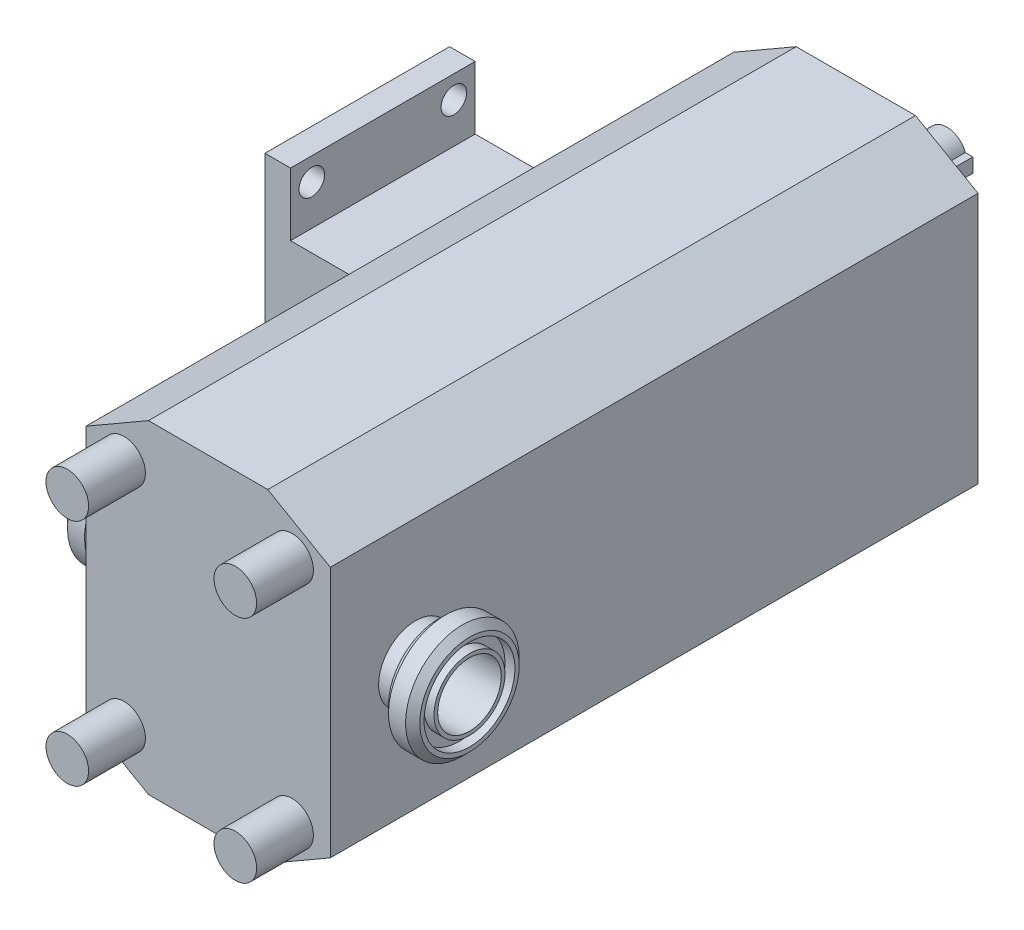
ISO-10303-21;
HEADER;
FILE_DESCRIPTION(('STEP AP214'),'2;1');
FILE_NAME('part.step','',(''),(''),'','','');
FILE_SCHEMA(('AUTOMOTIVE_DESIGN { 1 0 10303 214 1 1 1 1 }'));
ENDSEC;
DATA;
#1=APPLICATION_CONTEXT('core data for automotive mechanical design processes');
#2=APPLICATION_PROTOCOL_DEFINITION('international standard','automotive_design',2000,#1);
#3=PRODUCT_CONTEXT('',#1,'mechanical');
#4=PRODUCT('Part','Part','',(#3));
#5=PRODUCT_RELATED_PRODUCT_CATEGORY('part','',(#4));
#6=PRODUCT_DEFINITION_FORMATION('','',#4);
#7=PRODUCT_DEFINITION_CONTEXT('part definition',#1,'design');
#8=PRODUCT_DEFINITION('design','',#6,#7);
#9=PRODUCT_DEFINITION_SHAPE('','',#8);
#10=(LENGTH_UNIT() NAMED_UNIT(*) SI_UNIT(.MILLI.,.METRE.));
#11=(NAMED_UNIT(*) PLANE_ANGLE_UNIT() SI_UNIT($,.RADIAN.));
#12=(NAMED_UNIT(*) SI_UNIT($,.STERADIAN.) SOLID_ANGLE_UNIT());
#13=UNCERTAINTY_MEASURE_WITH_UNIT(LENGTH_MEASURE(1.E-05),#10,'distance_accuracy_value','');
#14=(GEOMETRIC_REPRESENTATION_CONTEXT(3) GLOBAL_UNCERTAINTY_ASSIGNED_CONTEXT((#13)) GLOBAL_UNIT_ASSIGNED_CONTEXT((#10,
#11,#12)) REPRESENTATION_CONTEXT('',''));
#15=CARTESIAN_POINT('',(0.,0.,0.));
#16=DIRECTION('',(0.,0.,1.));
#17=DIRECTION('',(1.,0.,0.));
#18=AXIS2_PLACEMENT_3D('',#15,#16,#17);
#19=CARTESIAN_POINT('',(58.5,-2.96008320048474,210.144459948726));
#20=DIRECTION('',(1.,0.,0.));
#21=DIRECTION('',(0.,0.971556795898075,0.236806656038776));
#22=AXIS2_PLACEMENT_3D('',#19,#20,#21);
#23=PLANE('',#22);
#24=CARTESIAN_POINT('',(58.5,0.,198.));
#25=DIRECTION('',(-1.,0.,0.));
#26=DIRECTION('',(0.,-0.971556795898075,-0.236806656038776));
#27=AXIS2_PLACEMENT_3D('',#24,#25,#26);
#28=CIRCLE('',#27,12.5);
#29=CARTESIAN_POINT('',(58.5,-12.144459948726,195.039916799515));
#30=VERTEX_POINT('',#29);
#31=EDGE_CURVE('P0_E58',#30,#30,#28,.T.);
#32=ORIENTED_EDGE('',*,*,#31,.T.);
#33=EDGE_LOOP('',(#32));
#34=FACE_BOUND('',#33,.T.);
#35=CARTESIAN_POINT('',(58.5,0.,198.));
#36=DIRECTION('',(-1.,0.,0.));
#37=DIRECTION('',(0.,-0.971556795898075,-0.236806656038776));
#38=AXIS2_PLACEMENT_3D('',#35,#36,#37);
#39=CIRCLE('',#38,16.);
#40=CARTESIAN_POINT('',(58.5,-15.5449087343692,194.21109350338));
#41=VERTEX_POINT('',#40);
#42=EDGE_CURVE('P0_E10',#41,#41,#39,.T.);
#43=ORIENTED_EDGE('',*,*,#42,.F.);
#44=EDGE_LOOP('',(#43));
#45=FACE_BOUND('',#44,.T.);
#46=ADVANCED_FACE('P0_F15',(#34,#45),#23,.T.);
#47=CARTESIAN_POINT('',(43.,0.,198.));
#48=DIRECTION('',(-1.,0.,0.));
#49=DIRECTION('',(0.,-0.971556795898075,-0.236806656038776));
#50=AXIS2_PLACEMENT_3D('',#47,#48,#49);
#51=CYLINDRICAL_SURFACE('',#50,16.);
#52=ORIENTED_EDGE('',*,*,#42,.T.);
#53=EDGE_LOOP('',(#52));
#54=FACE_BOUND('',#53,.T.);
#55=CARTESIAN_POINT('',(62.,0.,198.));
#56=DIRECTION('',(-1.,0.,0.));
#57=DIRECTION('',(0.,-0.971556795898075,-0.236806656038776));
#58=AXIS2_PLACEMENT_3D('',#55,#56,#57);
#59=CIRCLE('',#58,16.);
#60=CARTESIAN_POINT('',(62.,-15.5449087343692,194.21109350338));
#61=VERTEX_POINT('',#60);
#62=EDGE_CURVE('P0_E21',#61,#61,#59,.T.);
#63=ORIENTED_EDGE('',*,*,#62,.F.);
#64=EDGE_LOOP('',(#63));
#65=FACE_BOUND('',#64,.T.);
#66=ADVANCED_FACE('P0_F77',(#54,#65),#51,.F.);
#67=CARTESIAN_POINT('',(62.,-3.78890649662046,213.544908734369));
#68=DIRECTION('',(1.,0.,0.));
#69=DIRECTION('',(0.,0.971556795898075,0.236806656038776));
#70=AXIS2_PLACEMENT_3D('',#67,#68,#69);
#71=PLANE('',#70);
#72=ORIENTED_EDGE('',*,*,#62,.T.);
#73=EDGE_LOOP('',(#72));
#74=FACE_BOUND('',#73,.T.);
#75=CARTESIAN_POINT('',(62.,0.,198.));
#76=DIRECTION('',(-1.,0.,0.));
#77=DIRECTION('',(0.,-0.971556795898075,-0.236806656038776));
#78=AXIS2_PLACEMENT_3D('',#75,#76,#77);
#79=CIRCLE('',#78,17.5);
#80=CARTESIAN_POINT('',(62.,-17.0022439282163,193.855883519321));
#81=VERTEX_POINT('',#80);
#82=EDGE_CURVE('P0_E25',#81,#81,#79,.T.);
#83=ORIENTED_EDGE('',*,*,#82,.F.);
#84=EDGE_LOOP('',(#83));
#85=FACE_BOUND('',#84,.T.);
#86=ADVANCED_FACE('P0_F81',(#74,#85),#71,.T.);
#87=CARTESIAN_POINT('',(59.5,0.,198.));
#88=DIRECTION('',(-1.,0.,0.));
#89=DIRECTION('',(0.,-0.971556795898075,-0.236806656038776));
#90=AXIS2_PLACEMENT_3D('',#87,#88,#89);
#91=CONICAL_SURFACE('',#90,20.,0.78539816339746);
#92=ORIENTED_EDGE('',*,*,#82,.T.);
#93=EDGE_LOOP('',(#92));
#94=FACE_BOUND('',#93,.T.);
#95=CARTESIAN_POINT('',(59.5,0.,198.));
#96=DIRECTION('',(-1.,0.,0.));
#97=DIRECTION('',(0.,-0.971556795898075,-0.236806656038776));
#98=AXIS2_PLACEMENT_3D('',#95,#96,#97);
#99=CIRCLE('',#98,20.);
#100=CARTESIAN_POINT('',(59.5,-19.4311359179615,193.263866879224));
#101=VERTEX_POINT('',#100);
#102=EDGE_CURVE('P0_E29',#101,#101,#99,.T.);
#103=ORIENTED_EDGE('',*,*,#102,.F.);
#104=EDGE_LOOP('',(#103));
#105=FACE_BOUND('',#104,.T.);
#106=ADVANCED_FACE('P0_F85',(#94,#105),#91,.T.);
#107=CARTESIAN_POINT('',(43.,0.,198.));
#108=DIRECTION('',(-1.,0.,0.));
#109=DIRECTION('',(0.,-0.971556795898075,-0.236806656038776));
#110=AXIS2_PLACEMENT_3D('',#107,#108,#109);
#111=CYLINDRICAL_SURFACE('',#110,20.);
#112=ORIENTED_EDGE('',*,*,#102,.T.);
#113=EDGE_LOOP('',(#112));
#114=FACE_BOUND('',#113,.T.);
#115=CARTESIAN_POINT('',(53.5,0.,198.));
#116=DIRECTION('',(-1.,0.,0.));
#117=DIRECTION('',(0.,-0.971556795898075,-0.236806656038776));
#118=AXIS2_PLACEMENT_3D('',#115,#116,#117);
#119=CIRCLE('',#118,20.);
#120=CARTESIAN_POINT('',(53.5,-19.4311359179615,193.263866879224));
#121=VERTEX_POINT('',#120);
#122=EDGE_CURVE('P0_E34',#121,#121,#119,.T.);
#123=ORIENTED_EDGE('',*,*,#122,.F.);
#124=EDGE_LOOP('',(#123));
#125=FACE_BOUND('',#124,.T.);
#126=ADVANCED_FACE('P0_F91',(#114,#125),#111,.T.);
#127=CARTESIAN_POINT('',(51.,0.,198.));
#128=DIRECTION('',(1.,0.,0.));
#129=DIRECTION('',(0.,0.971556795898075,0.236806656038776));
#130=AXIS2_PLACEMENT_3D('',#127,#128,#129);
#131=CONICAL_SURFACE('',#130,17.5,0.785398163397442);
#132=ORIENTED_EDGE('',*,*,#122,.T.);
#133=EDGE_LOOP('',(#132));
#134=FACE_BOUND('',#133,.T.);
#135=CARTESIAN_POINT('',(51.,0.,198.));
#136=DIRECTION('',(-1.,0.,0.));
#137=DIRECTION('',(0.,-0.971556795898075,-0.236806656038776));
#138=AXIS2_PLACEMENT_3D('',#135,#136,#137);
#139=CIRCLE('',#138,17.5);
#140=CARTESIAN_POINT('',(51.,-17.0022439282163,193.855883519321));
#141=VERTEX_POINT('',#140);
#142=EDGE_CURVE('P0_E37',#141,#141,#139,.T.);
#143=ORIENTED_EDGE('',*,*,#142,.F.);
#144=EDGE_LOOP('',(#143));
#145=FACE_BOUND('',#144,.T.);
#146=ADVANCED_FACE('P0_F95',(#134,#145),#131,.T.);
#147=CARTESIAN_POINT('',(51.,-4.14411648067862,215.002243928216));
#148=DIRECTION('',(-1.,0.,0.));
#149=DIRECTION('',(0.,-0.971556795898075,-0.236806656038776));
#150=AXIS2_PLACEMENT_3D('',#147,#148,#149);
#151=PLANE('',#150);
#152=ORIENTED_EDGE('',*,*,#142,.T.);
#153=EDGE_LOOP('',(#152));
#154=FACE_BOUND('',#153,.T.);
#155=CARTESIAN_POINT('',(51.,0.,198.));
#156=DIRECTION('',(-1.,0.,0.));
#157=DIRECTION('',(0.,-0.971556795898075,-0.236806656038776));
#158=AXIS2_PLACEMENT_3D('',#155,#156,#157);
#159=CIRCLE('',#158,15.5);
#160=CARTESIAN_POINT('',(51.,-15.0591303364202,194.329496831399));
#161=VERTEX_POINT('',#160);
#162=EDGE_CURVE('P0_E40',#161,#161,#159,.T.);
#163=ORIENTED_EDGE('',*,*,#162,.F.);
#164=EDGE_LOOP('',(#163));
#165=FACE_BOUND('',#164,.T.);
#166=ADVANCED_FACE('P0_F99',(#154,#165),#151,.T.);
#167=CARTESIAN_POINT('',(48.5,0.,198.));
#168=DIRECTION('',(-1.,0.,0.));
#169=DIRECTION('',(0.,-0.971556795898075,-0.236806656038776));
#170=AXIS2_PLACEMENT_3D('',#167,#168,#169);
#171=TOROIDAL_SURFACE('',#170,15.5,2.5);
#172=ORIENTED_EDGE('',*,*,#162,.T.);
#173=EDGE_LOOP('',(#172));
#174=FACE_BOUND('',#173,.T.);
#175=CARTESIAN_POINT('',(48.5,0.,198.));
#176=DIRECTION('',(-1.,0.,0.));
#177=DIRECTION('',(0.,-0.971556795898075,-0.236806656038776));
#178=AXIS2_PLACEMENT_3D('',#175,#176,#177);
#179=CIRCLE('',#178,13.);
#180=CARTESIAN_POINT('',(48.5,-12.630238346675,194.921513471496));
#181=VERTEX_POINT('',#180);
#182=EDGE_CURVE('P0_E43',#181,#181,#179,.T.);
#183=ORIENTED_EDGE('',*,*,#182,.F.);
#184=EDGE_LOOP('',(#183));
#185=FACE_BOUND('',#184,.T.);
#186=ADVANCED_FACE('P0_F103',(#174,#185),#171,.F.);
#187=CARTESIAN_POINT('',(43.,0.,198.));
#188=DIRECTION('',(-1.,0.,0.));
#189=DIRECTION('',(0.,-0.971556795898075,-0.236806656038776));
#190=AXIS2_PLACEMENT_3D('',#187,#188,#189);
#191=CYLINDRICAL_SURFACE('',#190,13.);
#192=ORIENTED_EDGE('',*,*,#182,.T.);
#193=EDGE_LOOP('',(#192));
#194=FACE_BOUND('',#193,.T.);
#195=CARTESIAN_POINT('',(43.,0.,198.));
#196=DIRECTION('',(-1.,0.,0.));
#197=DIRECTION('',(0.,-0.971556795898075,-0.236806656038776));
#198=AXIS2_PLACEMENT_3D('',#195,#196,#197);
#199=CIRCLE('',#198,13.);
#200=CARTESIAN_POINT('',(43.,-12.630238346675,194.921513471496));
#201=VERTEX_POINT('',#200);
#202=EDGE_CURVE('P0_E46',#201,#201,#199,.T.);
#203=ORIENTED_EDGE('',*,*,#202,.F.);
#204=EDGE_LOOP('',(#203));
#205=FACE_BOUND('',#204,.T.);
#206=ADVANCED_FACE('P0_F107',(#194,#205),#191,.T.);
#207=CARTESIAN_POINT('',(43.,-3.07848652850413,210.630238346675));
#208=DIRECTION('',(-1.,0.,0.));
#209=DIRECTION('',(0.,-0.971556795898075,-0.236806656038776));
#210=AXIS2_PLACEMENT_3D('',#207,#208,#209);
#211=PLANE('',#210);
#212=ORIENTED_EDGE('',*,*,#202,.T.);
#213=EDGE_LOOP('',(#212));
#214=FACE_BOUND('',#213,.T.);
#215=CARTESIAN_POINT('',(43.,0.,198.));
#216=DIRECTION('',(-1.,0.,0.));
#217=DIRECTION('',(0.,-0.971556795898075,-0.236806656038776));
#218=AXIS2_PLACEMENT_3D('',#215,#216,#217);
#219=CIRCLE('',#218,11.2);
#220=CARTESIAN_POINT('',(43.,-10.8814361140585,195.347765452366));
#221=VERTEX_POINT('',#220);
#222=EDGE_CURVE('P0_E49',#221,#221,#219,.T.);
#223=ORIENTED_EDGE('',*,*,#222,.F.);
#224=EDGE_LOOP('',(#223));
#225=FACE_BOUND('',#224,.T.);
#226=ADVANCED_FACE('P0_F111',(#214,#225),#211,.T.);
#227=CARTESIAN_POINT('',(43.,0.,198.));
#228=DIRECTION('',(-1.,0.,0.));
#229=DIRECTION('',(0.,-0.971556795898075,-0.236806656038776));
#230=AXIS2_PLACEMENT_3D('',#227,#228,#229);
#231=CYLINDRICAL_SURFACE('',#230,11.2);
#232=ORIENTED_EDGE('',*,*,#222,.T.);
#233=EDGE_LOOP('',(#232));
#234=FACE_BOUND('',#233,.T.);
#235=CARTESIAN_POINT('',(62.,0.,198.));
#236=DIRECTION('',(-1.,0.,0.));
#237=DIRECTION('',(0.,-0.971556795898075,-0.236806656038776));
#238=AXIS2_PLACEMENT_3D('',#235,#236,#237);
#239=CIRCLE('',#238,11.2);
#240=CARTESIAN_POINT('',(62.,-10.8814361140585,195.347765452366));
#241=VERTEX_POINT('',#240);
#242=EDGE_CURVE('P0_E52',#241,#241,#239,.T.);
#243=ORIENTED_EDGE('',*,*,#242,.F.);
#244=EDGE_LOOP('',(#243));
#245=FACE_BOUND('',#244,.T.);
#246=ADVANCED_FACE('P0_F73',(#234,#245),#231,.F.);
#247=CARTESIAN_POINT('',(62.,-2.65223454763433,208.881436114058));
#248=DIRECTION('',(1.,0.,0.));
#249=DIRECTION('',(0.,0.971556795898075,0.236806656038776));
#250=AXIS2_PLACEMENT_3D('',#247,#248,#249);
#251=PLANE('',#250);
#252=ORIENTED_EDGE('',*,*,#242,.T.);
#253=EDGE_LOOP('',(#252));
#254=FACE_BOUND('',#253,.T.);
#255=CARTESIAN_POINT('',(62.,0.,198.));
#256=DIRECTION('',(-1.,0.,0.));
#257=DIRECTION('',(0.,-0.971556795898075,-0.236806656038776));
#258=AXIS2_PLACEMENT_3D('',#255,#256,#257);
#259=CIRCLE('',#258,12.5);
#260=CARTESIAN_POINT('',(62.,-12.144459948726,195.039916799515));
#261=VERTEX_POINT('',#260);
#262=EDGE_CURVE('P0_E55',#261,#261,#259,.T.);
#263=ORIENTED_EDGE('',*,*,#262,.F.);
#264=EDGE_LOOP('',(#263));
#265=FACE_BOUND('',#264,.T.);
#266=ADVANCED_FACE('P0_F66',(#254,#265),#251,.T.);
#267=CARTESIAN_POINT('',(43.,0.,198.));
#268=DIRECTION('',(-1.,0.,0.));
#269=DIRECTION('',(0.,-0.971556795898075,-0.236806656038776));
#270=AXIS2_PLACEMENT_3D('',#267,#268,#269);
#271=CYLINDRICAL_SURFACE('',#270,12.5);
#272=ORIENTED_EDGE('',*,*,#262,.T.);
#273=EDGE_LOOP('',(#272));
#274=FACE_BOUND('',#273,.T.);
#275=ORIENTED_EDGE('',*,*,#31,.F.);
#276=EDGE_LOOP('',(#275));
#277=FACE_BOUND('',#276,.T.);
#278=ADVANCED_FACE('P0_F64',(#274,#277),#271,.T.);
#279=CLOSED_SHELL('',(#46,#66,#86,#106,#126,#146,#166,#186,#206,#226,#246,#266,#278));
#280=MANIFOLD_SOLID_BREP('P0_B1',#279);
#281=CARTESIAN_POINT('',(-43.,-44.2982940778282,228.));
#282=DIRECTION('',(1.,0.,0.));
#283=DIRECTION('',(0.,0.,-1.));
#284=AXIS2_PLACEMENT_3D('',#281,#282,#283);
#285=PLANE('',#284);
#286=DIRECTION('',(0.,-1.,0.));
#287=VECTOR('',#286,1.);
#288=CARTESIAN_POINT('',(-43.,-44.2982940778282,0.));
#289=LINE('',#288,#287);
#290=CARTESIAN_POINT('',(-43.,44.2982940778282,0.));
#291=VERTEX_POINT('',#290);
#292=CARTESIAN_POINT('',(-43.,-44.2982940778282,0.));
#293=VERTEX_POINT('',#292);
#294=EDGE_CURVE('P1_E290',#291,#293,#289,.T.);
#295=ORIENTED_EDGE('',*,*,#294,.T.);
#296=DIRECTION('',(0.,0.,-1.));
#297=VECTOR('',#296,1.);
#298=CARTESIAN_POINT('',(-43.,-44.2982940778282,228.));
#299=LINE('',#298,#297);
#300=CARTESIAN_POINT('',(-43.,-44.2982940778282,228.));
#301=VERTEX_POINT('',#300);
#302=EDGE_CURVE('P1_E320',#301,#293,#299,.T.);
#303=ORIENTED_EDGE('',*,*,#302,.F.);
#304=DIRECTION('',(0.,-1.,0.));
#305=VECTOR('',#304,1.);
#306=CARTESIAN_POINT('',(-43.,-44.2982940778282,228.));
#307=LINE('',#306,#305);
#308=CARTESIAN_POINT('',(-43.,44.2982940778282,228.));
#309=VERTEX_POINT('',#308);
#310=EDGE_CURVE('P1_E272',#309,#301,#307,.T.);
#311=ORIENTED_EDGE('',*,*,#310,.F.);
#312=DIRECTION('',(0.,0.,-1.));
#313=VECTOR('',#312,1.);
#314=CARTESIAN_POINT('',(-43.,44.2982940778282,228.));
#315=LINE('',#314,#313);
#316=EDGE_CURVE('P1_E323',#309,#291,#315,.T.);
#317=ORIENTED_EDGE('',*,*,#316,.T.);
#318=EDGE_LOOP('',(#295,#303,#311,#317));
#319=FACE_BOUND('',#318,.T.);
#320=CARTESIAN_POINT('',(-43.,0.,198.));
#321=DIRECTION('',(1.,0.,0.));
#322=DIRECTION('',(0.,1.,0.));
#323=AXIS2_PLACEMENT_3D('',#320,#321,#322);
#324=CIRCLE('',#323,11.2);
#325=CARTESIAN_POINT('',(-43.,11.2,198.));
#326=VERTEX_POINT('',#325);
#327=EDGE_CURVE('P1_E214',#326,#326,#324,.T.);
#328=ORIENTED_EDGE('',*,*,#327,.T.);
#329=EDGE_LOOP('',(#328));
#330=FACE_BOUND('',#329,.T.);
#331=DIRECTION('',(0.,-1.,0.));
#332=VECTOR('',#331,1.);
#333=CARTESIAN_POINT('',(-43.,-44.2982940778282,63.));
#334=LINE('',#333,#332);
#335=CARTESIAN_POINT('',(-43.,36.8601182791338,63.));
#336=VERTEX_POINT('',#335);
#337=CARTESIAN_POINT('',(-43.,-36.8601182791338,63.));
#338=VERTEX_POINT('',#337);
#339=EDGE_CURVE('P1_E11',#336,#338,#334,.T.);
#340=ORIENTED_EDGE('',*,*,#339,.F.);
#341=DIRECTION('',(0.,0.,-1.));
#342=VECTOR('',#341,1.);
#343=CARTESIAN_POINT('',(-43.,36.8601182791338,228.));
#344=LINE('',#343,#342);
#345=CARTESIAN_POINT('',(-43.,36.8601182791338,128.));
#346=VERTEX_POINT('',#345);
#347=EDGE_CURVE('P1_E570',#346,#336,#344,.T.);
#348=ORIENTED_EDGE('',*,*,#347,.F.);
#349=DIRECTION('',(0.,-1.,0.));
#350=VECTOR('',#349,1.);
#351=CARTESIAN_POINT('',(-43.,-44.2982940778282,128.));
#352=LINE('',#351,#350);
#353=CARTESIAN_POINT('',(-43.,-36.8601182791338,128.));
#354=VERTEX_POINT('',#353);
#355=EDGE_CURVE('P1_E343',#346,#354,#352,.T.);
#356=ORIENTED_EDGE('',*,*,#355,.T.);
#357=DIRECTION('',(0.,0.,1.));
#358=VECTOR('',#357,1.);
#359=CARTESIAN_POINT('',(-43.,-36.8601182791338,228.));
#360=LINE('',#359,#358);
#361=EDGE_CURVE('P1_E25',#338,#354,#360,.T.);
#362=ORIENTED_EDGE('',*,*,#361,.F.);
#363=EDGE_LOOP('',(#340,#348,#356,#362));
#364=FACE_BOUND('',#363,.T.);
#365=ADVANCED_FACE('P1_F17',(#319,#330,#364),#285,.F.);
#366=CARTESIAN_POINT('',(0.,20.,219.362441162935));
#367=DIRECTION('',(0.,0.,1.));
#368=DIRECTION('',(1.,0.,0.));
#369=AXIS2_PLACEMENT_3D('',#366,#367,#368);
#370=CYLINDRICAL_SURFACE('',#369,7.);
#371=CARTESIAN_POINT('',(0.,20.,-2.));
#372=DIRECTION('',(0.,0.,1.));
#373=DIRECTION('',(1.,0.,0.));
#374=AXIS2_PLACEMENT_3D('',#371,#372,#373);
#375=CIRCLE('',#374,7.);
#376=CARTESIAN_POINT('',(7.,20.,-2.));
#377=VERTEX_POINT('',#376);
#378=EDGE_CURVE('P1_E247',#377,#377,#375,.T.);
#379=ORIENTED_EDGE('',*,*,#378,.F.);
#380=EDGE_LOOP('',(#379));
#381=FACE_BOUND('',#380,.T.);
#382=DIRECTION('',(0.,0.,1.));
#383=VECTOR('',#382,1.);
#384=CARTESIAN_POINT('',(6.53834841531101,22.5,219.362441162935));
#385=LINE('',#384,#383);
#386=CARTESIAN_POINT('',(6.53834841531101,22.5,-32.));
#387=VERTEX_POINT('',#386);
#388=CARTESIAN_POINT('',(6.53834841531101,22.5,-17.));
#389=VERTEX_POINT('',#388);
#390=EDGE_CURVE('P1_E243',#387,#389,#385,.T.);
#391=ORIENTED_EDGE('',*,*,#390,.F.);
#392=CARTESIAN_POINT('',(0.,20.,-32.));
#393=DIRECTION('',(0.,0.,1.));
#394=DIRECTION('',(1.,0.,0.));
#395=AXIS2_PLACEMENT_3D('',#392,#393,#394);
#396=CIRCLE('',#395,7.);
#397=CARTESIAN_POINT('',(6.53834841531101,17.5,-32.));
#398=VERTEX_POINT('',#397);
#399=EDGE_CURVE('P1_E245',#387,#398,#396,.T.);
#400=ORIENTED_EDGE('',*,*,#399,.T.);
#401=DIRECTION('',(0.,0.,1.));
#402=VECTOR('',#401,1.);
#403=CARTESIAN_POINT('',(6.53834841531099,17.4999999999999,219.362441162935));
#404=LINE('',#403,#402);
#405=CARTESIAN_POINT('',(6.53834841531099,17.4999999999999,-17.));
#406=VERTEX_POINT('',#405);
#407=EDGE_CURVE('P1_E240',#406,#398,#404,.F.);
#408=ORIENTED_EDGE('',*,*,#407,.F.);
#409=CARTESIAN_POINT('',(7.,20.,-19.5));
#410=CARTESIAN_POINT('',(7.0000020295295,20.1358397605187,-19.5000028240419));
#411=CARTESIAN_POINT('',(6.99601056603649,20.2716594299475,-19.4888932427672));
#412=CARTESIAN_POINT('',(6.98048404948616,20.5392648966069,-19.444908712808));
#413=CARTESIAN_POINT('',(6.96894928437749,20.6710508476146,-19.4120345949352));
#414=CARTESIAN_POINT('',(6.93958109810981,20.9266921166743,-19.3258148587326));
#415=CARTESIAN_POINT('',(6.92175912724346,21.0505613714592,-19.2725064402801));
#416=CARTESIAN_POINT('',(6.88161078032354,21.287595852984,-19.1471112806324));
#417=CARTESIAN_POINT('',(6.85928332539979,21.4007585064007,-19.075020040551));
#418=CARTESIAN_POINT('',(6.81147377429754,21.6175880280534,-18.9111568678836));
#419=CARTESIAN_POINT('',(6.78590827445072,21.7207801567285,-18.8187812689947));
#420=CARTESIAN_POINT('',(6.73493522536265,21.9105819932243,-18.6182536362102));
#421=CARTESIAN_POINT('',(6.70952771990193,21.9971872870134,-18.5100974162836));
#422=CARTESIAN_POINT('',(6.6608007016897,22.1542373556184,-18.2766022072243));
#423=CARTESIAN_POINT('',(6.63758107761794,22.2240352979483,-18.1508052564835));
#424=CARTESIAN_POINT('',(6.59714352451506,22.3412757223,-17.8882963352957));
#425=CARTESIAN_POINT('',(6.57992345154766,22.3887261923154,-17.7515882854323));
#426=CARTESIAN_POINT('',(6.55432038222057,22.4580913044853,-17.4765771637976));
#427=CARTESIAN_POINT('',(6.54562733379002,22.4809051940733,-17.3385306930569));
#428=CARTESIAN_POINT('',(6.53715061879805,22.5031615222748,-17.0603163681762));
#429=CARTESIAN_POINT('',(6.53736369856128,22.5026124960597,-16.9201493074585));
#430=CARTESIAN_POINT('',(6.54640588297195,22.4788507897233,-16.6496443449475));
#431=CARTESIAN_POINT('',(6.55477363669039,22.4568516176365,-16.5191816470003));
#432=CARTESIAN_POINT('',(6.57842082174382,22.3928085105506,-16.2639384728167));
#433=CARTESIAN_POINT('',(6.59370119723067,22.3507618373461,-16.1391587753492));
#434=CARTESIAN_POINT('',(6.62975170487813,22.247095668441,-15.8962262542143));
#435=CARTESIAN_POINT('',(6.65061447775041,22.1851419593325,-15.7782303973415));
#436=CARTESIAN_POINT('',(6.69544469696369,22.0436527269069,-15.5539436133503));
#437=CARTESIAN_POINT('',(6.71941314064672,21.9641115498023,-15.4476564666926));
#438=CARTESIAN_POINT('',(6.76952498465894,21.784031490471,-15.2430404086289));
#439=CARTESIAN_POINT('',(6.7957122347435,21.6825133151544,-15.1455821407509));
#440=CARTESIAN_POINT('',(6.84605473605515,21.4642618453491,-14.9688283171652));
#441=CARTESIAN_POINT('',(6.87020973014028,21.3475266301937,-14.8895350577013));
#442=CARTESIAN_POINT('',(6.91416998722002,21.1001003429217,-14.7505193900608));
#443=CARTESIAN_POINT('',(6.93391532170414,20.9692491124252,-14.6910617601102));
#444=CARTESIAN_POINT('',(6.96639167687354,20.6985234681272,-14.5952841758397));
#445=CARTESIAN_POINT('',(6.97912551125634,20.5586526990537,-14.5589549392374));
#446=CARTESIAN_POINT('',(6.99566202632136,20.2812050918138,-14.5120808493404));
#447=CARTESIAN_POINT('',(6.99987103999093,20.1438506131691,-14.5003618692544));
#448=CARTESIAN_POINT('',(7.00012297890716,19.8690906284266,-14.4996548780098));
#449=CARTESIAN_POINT('',(6.99616751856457,19.7316851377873,-14.5106623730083));
#450=CARTESIAN_POINT('',(6.98080349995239,19.4656313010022,-14.5541861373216));
#451=CARTESIAN_POINT('',(6.96965417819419,19.3368441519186,-14.5859547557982));
#452=CARTESIAN_POINT('',(6.94128245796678,19.08650055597,-14.6691365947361));
#453=CARTESIAN_POINT('',(6.9240592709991,18.9649450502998,-14.7205523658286));
#454=CARTESIAN_POINT('',(6.88465739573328,18.728682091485,-14.8431588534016));
#455=CARTESIAN_POINT('',(6.86235262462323,18.6142645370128,-14.9148664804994));
#456=CARTESIAN_POINT('',(6.81528395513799,18.3987206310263,-15.0754274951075));
#457=CARTESIAN_POINT('',(6.79051921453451,18.2975988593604,-15.1642867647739));
#458=CARTESIAN_POINT('',(6.73966040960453,18.1059770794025,-15.3621296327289));
#459=CARTESIAN_POINT('',(6.71356479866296,18.0163131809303,-15.4719247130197));
#460=CARTESIAN_POINT('',(6.66427875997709,17.856544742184,-15.7055412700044));
#461=CARTESIAN_POINT('',(6.64108847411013,17.7864411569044,-15.8293634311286));
#462=CARTESIAN_POINT('',(6.60040332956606,17.6679131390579,-16.0880648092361));
#463=CARTESIAN_POINT('',(6.58291456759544,17.6195118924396,-16.2229556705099));
#464=CARTESIAN_POINT('',(6.55601442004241,17.5463858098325,-16.4997601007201));
#465=CARTESIAN_POINT('',(6.54659865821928,17.5216481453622,-16.6416698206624));
#466=CARTESIAN_POINT('',(6.53745596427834,17.4976374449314,-16.919520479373));
#467=CARTESIAN_POINT('',(6.53719306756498,17.4969557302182,-17.0553232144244));
#468=CARTESIAN_POINT('',(6.54503319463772,17.5175296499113,-17.3249976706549));
#469=CARTESIAN_POINT('',(6.55313556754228,17.5387835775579,-17.4588695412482));
#470=CARTESIAN_POINT('',(6.57636700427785,17.601569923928,-17.7175005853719));
#471=CARTESIAN_POINT('',(6.59131474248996,17.6425803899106,-17.8424040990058));
#472=CARTESIAN_POINT('',(6.62646329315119,17.7432735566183,-18.0836426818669));
#473=CARTESIAN_POINT('',(6.64666536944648,17.802960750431,-18.1999756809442));
#474=CARTESIAN_POINT('',(6.69127230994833,17.9426968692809,-18.4269257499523));
#475=CARTESIAN_POINT('',(6.71583400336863,18.0235962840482,-18.5369880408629));
#476=CARTESIAN_POINT('',(6.76580411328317,18.2020913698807,-18.7424275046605));
#477=CARTESIAN_POINT('',(6.79121278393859,18.2996920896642,-18.837800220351));
#478=CARTESIAN_POINT('',(6.84145445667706,18.5143374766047,-19.0157219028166));
#479=CARTESIAN_POINT('',(6.86620367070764,18.6320824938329,-19.0974530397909));
#480=CARTESIAN_POINT('',(6.91104924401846,18.8804886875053,-19.2399076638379));
#481=CARTESIAN_POINT('',(6.93114595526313,19.011148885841,-19.3006327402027));
#482=CARTESIAN_POINT('',(6.96446006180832,19.282353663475,-19.3991403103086));
#483=CARTESIAN_POINT('',(6.97764821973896,19.4229374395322,-19.4368254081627));
#484=CARTESIAN_POINT('',(6.99541542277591,19.7090231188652,-19.4872488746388));
#485=CARTESIAN_POINT('',(6.99999782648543,19.8545230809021,-19.4999969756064));
#486=CARTESIAN_POINT('',(7.,20.,-19.5));
#487=B_SPLINE_CURVE_WITH_KNOTS('',3,(#409,#410,#411,#412,#413,#414,#415,#416,#417,#418,#419,
#420,#421,#422,#423,#424,#425,#426,#427,#428,#429,#430,#431,#432,#433,#434,#435,#436,#437,#438,
#439,#440,#441,#442,#443,#444,#445,#446,#447,#448,#449,#450,#451,#452,#453,#454,#455,#456,#457,
#458,#459,#460,#461,#462,#463,#464,#465,#466,#467,#468,#469,#470,#471,#472,#473,#474,#475,#476,
#477,#478,#479,#480,#481,#482,#483,#484,#485,#486),.UNSPECIFIED.,.T.,.F.,(4,2,2,2,2,2,2,2,2,2,2,
2,2,2,2,2,2,2,2,2,2,2,2,2,2,2,2,2,2,2,2,2,2,2,2,2,2,2,4),(0.,0.406983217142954,
0.813950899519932,1.22018120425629,1.62650889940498,2.04714572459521,2.46789433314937,
2.90289606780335,3.3377421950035,3.75611562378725,4.17433620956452,4.57019246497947,
4.96610280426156,5.36904149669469,5.77210990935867,6.19956653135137,6.62707715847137,
7.06008524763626,7.49291944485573,7.90458529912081,8.31616976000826,8.71369326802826,
9.11126840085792,9.52005856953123,9.92898918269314,10.3593838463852,10.7897995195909,
11.2206739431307,11.6513146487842,12.0566930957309,12.4620400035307,12.8572208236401,
13.2524967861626,13.6670344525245,14.0816976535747,14.5159343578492,14.9501382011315,
15.3861650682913,15.8220217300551),.UNSPECIFIED.);
#488=EDGE_CURVE('P1_E40',#389,#406,#487,.T.);
#489=ORIENTED_EDGE('',*,*,#488,.F.);
#490=EDGE_LOOP('',(#391,#400,#408,#489));
#491=FACE_BOUND('',#490,.T.);
#492=ADVANCED_FACE('P1_F345',(#381,#491),#370,.T.);
#493=CARTESIAN_POINT('',(-119.726896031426,0.,0.));
#494=DIRECTION('',(0.,0.,-1.));
#495=DIRECTION('',(-1.,0.,0.));
#496=AXIS2_PLACEMENT_3D('',#493,#494,#495);
#497=PLANE('',#496);
#498=DIRECTION('',(-0.866025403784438,-0.500000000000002,0.));
#499=VECTOR('',#498,1.);
#500=CARTESIAN_POINT('',(-43.,44.2982940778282,0.));
#501=LINE('',#500,#499);
#502=CARTESIAN_POINT('',(-21.,57.,0.));
#503=VERTEX_POINT('',#502);
#504=EDGE_CURVE('P1_E268',#503,#291,#501,.T.);
#505=ORIENTED_EDGE('',*,*,#504,.F.);
#506=DIRECTION('',(-1.,0.,0.));
#507=VECTOR('',#506,1.);
#508=CARTESIAN_POINT('',(-21.,57.,0.));
#509=LINE('',#508,#507);
#510=CARTESIAN_POINT('',(21.,57.,0.));
#511=VERTEX_POINT('',#510);
#512=EDGE_CURVE('P1_E273',#511,#503,#509,.T.);
#513=ORIENTED_EDGE('',*,*,#512,.F.);
#514=DIRECTION('',(-0.866025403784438,0.500000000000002,0.));
#515=VECTOR('',#514,1.);
#516=CARTESIAN_POINT('',(21.,57.,0.));
#517=LINE('',#516,#515);
#518=CARTESIAN_POINT('',(43.,44.2982940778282,0.));
#519=VERTEX_POINT('',#518);
#520=EDGE_CURVE('P1_E300',#519,#511,#517,.T.);
#521=ORIENTED_EDGE('',*,*,#520,.F.);
#522=DIRECTION('',(0.,1.,0.));
#523=VECTOR('',#522,1.);
#524=CARTESIAN_POINT('',(42.9999999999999,-44.2982940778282,0.));
#525=LINE('',#524,#523);
#526=CARTESIAN_POINT('',(42.9999999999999,-44.2982940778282,0.));
#527=VERTEX_POINT('',#526);
#528=EDGE_CURVE('P1_E298',#527,#519,#525,.T.);
#529=ORIENTED_EDGE('',*,*,#528,.F.);
#530=DIRECTION('',(0.866025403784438,0.500000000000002,0.));
#531=VECTOR('',#530,1.);
#532=CARTESIAN_POINT('',(20.9999999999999,-57.,0.));
#533=LINE('',#532,#531);
#534=CARTESIAN_POINT('',(20.9999999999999,-57.,0.));
#535=VERTEX_POINT('',#534);
#536=EDGE_CURVE('P1_E296',#535,#527,#533,.T.);
#537=ORIENTED_EDGE('',*,*,#536,.F.);
#538=DIRECTION('',(1.,0.,0.));
#539=VECTOR('',#538,1.);
#540=CARTESIAN_POINT('',(-21.,-57.,0.));
#541=LINE('',#540,#539);
#542=CARTESIAN_POINT('',(-21.,-57.,0.));
#543=VERTEX_POINT('',#542);
#544=EDGE_CURVE('P1_E294',#543,#535,#541,.T.);
#545=ORIENTED_EDGE('',*,*,#544,.F.);
#546=DIRECTION('',(0.866025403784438,-0.500000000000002,0.));
#547=VECTOR('',#546,1.);
#548=CARTESIAN_POINT('',(-43.,-44.2982940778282,0.));
#549=LINE('',#548,#547);
#550=EDGE_CURVE('P1_E292',#293,#543,#549,.T.);
#551=ORIENTED_EDGE('',*,*,#550,.F.);
#552=ORIENTED_EDGE('',*,*,#294,.F.);
#553=EDGE_LOOP('',(#505,#513,#521,#529,#537,#545,#551,#552));
#554=FACE_BOUND('',#553,.T.);
#555=CARTESIAN_POINT('',(0.,20.,0.));
#556=DIRECTION('',(0.,0.,1.));
#557=DIRECTION('',(1.,0.,0.));
#558=AXIS2_PLACEMENT_3D('',#555,#556,#557);
#559=CIRCLE('',#558,10.);
#560=CARTESIAN_POINT('',(10.,20.,0.));
#561=VERTEX_POINT('',#560);
#562=EDGE_CURVE('P1_E253',#561,#561,#559,.T.);
#563=ORIENTED_EDGE('',*,*,#562,.T.);
#564=EDGE_LOOP('',(#563));
#565=FACE_BOUND('',#564,.T.);
#566=ADVANCED_FACE('P1_F378',(#554,#565),#497,.T.);
#567=CARTESIAN_POINT('',(-119.726896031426,0.,228.));
#568=DIRECTION('',(0.,0.,-1.));
#569=DIRECTION('',(-1.,0.,0.));
#570=AXIS2_PLACEMENT_3D('',#567,#568,#569);
#571=PLANE('',#570);
#572=CARTESIAN_POINT('',(29.5708036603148,-40.3888822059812,228.));
#573=DIRECTION('',(0.,0.,-1.));
#574=DIRECTION('',(-1.,0.,0.));
#575=AXIS2_PLACEMENT_3D('',#572,#573,#574);
#576=CIRCLE('',#575,7.5);
#577=CARTESIAN_POINT('',(22.0708036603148,-40.3888822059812,228.));
#578=VERTEX_POINT('',#577);
#579=EDGE_CURVE('P1_E332',#578,#578,#576,.F.);
#580=ORIENTED_EDGE('',*,*,#579,.F.);
#581=EDGE_LOOP('',(#580));
#582=FACE_BOUND('',#581,.T.);
#583=CARTESIAN_POINT('',(-29.5708036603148,40.3888822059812,228.));
#584=DIRECTION('',(0.,0.,-1.));
#585=DIRECTION('',(-1.,0.,0.));
#586=AXIS2_PLACEMENT_3D('',#583,#584,#585);
#587=CIRCLE('',#586,7.5);
#588=CARTESIAN_POINT('',(-37.0708036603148,40.3888822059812,228.));
#589=VERTEX_POINT('',#588);
#590=EDGE_CURVE('P1_E326',#589,#589,#587,.F.);
#591=ORIENTED_EDGE('',*,*,#590,.F.);
#592=EDGE_LOOP('',(#591));
#593=FACE_BOUND('',#592,.T.);
#594=DIRECTION('',(-0.866025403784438,-0.500000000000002,0.));
#595=VECTOR('',#594,1.);
#596=CARTESIAN_POINT('',(-43.,44.2982940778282,228.));
#597=LINE('',#596,#595);
#598=CARTESIAN_POINT('',(-21.,57.,228.));
#599=VERTEX_POINT('',#598);
#600=EDGE_CURVE('P1_E269',#599,#309,#597,.T.);
#601=ORIENTED_EDGE('',*,*,#600,.T.);
#602=ORIENTED_EDGE('',*,*,#310,.T.);
#603=DIRECTION('',(0.866025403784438,-0.500000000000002,0.));
#604=VECTOR('',#603,1.);
#605=CARTESIAN_POINT('',(-43.,-44.2982940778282,228.));
#606=LINE('',#605,#604);
#607=CARTESIAN_POINT('',(-21.,-57.,228.));
#608=VERTEX_POINT('',#607);
#609=EDGE_CURVE('P1_E275',#301,#608,#606,.T.);
#610=ORIENTED_EDGE('',*,*,#609,.T.);
#611=DIRECTION('',(1.,0.,0.));
#612=VECTOR('',#611,1.);
#613=CARTESIAN_POINT('',(-21.,-57.,228.));
#614=LINE('',#613,#612);
#615=CARTESIAN_POINT('',(20.9999999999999,-57.,228.));
#616=VERTEX_POINT('',#615);
#617=EDGE_CURVE('P1_E277',#608,#616,#614,.T.);
#618=ORIENTED_EDGE('',*,*,#617,.T.);
#619=DIRECTION('',(0.866025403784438,0.500000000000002,0.));
#620=VECTOR('',#619,1.);
#621=CARTESIAN_POINT('',(20.9999999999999,-57.,228.));
#622=LINE('',#621,#620);
#623=CARTESIAN_POINT('',(42.9999999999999,-44.2982940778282,228.));
#624=VERTEX_POINT('',#623);
#625=EDGE_CURVE('P1_E279',#616,#624,#622,.T.);
#626=ORIENTED_EDGE('',*,*,#625,.T.);
#627=DIRECTION('',(0.,1.,0.));
#628=VECTOR('',#627,1.);
#629=CARTESIAN_POINT('',(42.9999999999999,-44.2982940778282,228.));
#630=LINE('',#629,#628);
#631=CARTESIAN_POINT('',(43.,44.2982940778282,228.));
#632=VERTEX_POINT('',#631);
#633=EDGE_CURVE('P1_E281',#624,#632,#630,.T.);
#634=ORIENTED_EDGE('',*,*,#633,.T.);
#635=DIRECTION('',(-0.866025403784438,0.500000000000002,0.));
#636=VECTOR('',#635,1.);
#637=CARTESIAN_POINT('',(21.,57.,228.));
#638=LINE('',#637,#636);
#639=CARTESIAN_POINT('',(21.,57.,228.));
#640=VERTEX_POINT('',#639);
#641=EDGE_CURVE('P1_E283',#632,#640,#638,.T.);
#642=ORIENTED_EDGE('',*,*,#641,.T.);
#643=DIRECTION('',(-1.,0.,0.));
#644=VECTOR('',#643,1.);
#645=CARTESIAN_POINT('',(-21.,57.,228.));
#646=LINE('',#645,#644);
#647=EDGE_CURVE('P1_E285',#640,#599,#646,.T.);
#648=ORIENTED_EDGE('',*,*,#647,.T.);
#649=EDGE_LOOP('',(#601,#602,#610,#618,#626,#634,#642,#648));
#650=FACE_BOUND('',#649,.T.);
#651=CARTESIAN_POINT('',(29.5708036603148,40.3888822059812,228.));
#652=DIRECTION('',(0.,0.,-1.));
#653=DIRECTION('',(-1.,0.,0.));
#654=AXIS2_PLACEMENT_3D('',#651,#652,#653);
#655=CIRCLE('',#654,7.5);
#656=CARTESIAN_POINT('',(22.0708036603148,40.3888822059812,228.));
#657=VERTEX_POINT('',#656);
#658=EDGE_CURVE('P1_E329',#657,#657,#655,.F.);
#659=ORIENTED_EDGE('',*,*,#658,.F.);
#660=EDGE_LOOP('',(#659));
#661=FACE_BOUND('',#660,.T.);
#662=CARTESIAN_POINT('',(-29.5708036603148,-40.3888822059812,228.));
#663=DIRECTION('',(0.,0.,-1.));
#664=DIRECTION('',(-1.,0.,0.));
#665=AXIS2_PLACEMENT_3D('',#662,#663,#664);
#666=CIRCLE('',#665,7.5);
#667=CARTESIAN_POINT('',(-37.0708036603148,-40.3888822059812,228.));
#668=VERTEX_POINT('',#667);
#669=EDGE_CURVE('P1_E335',#668,#668,#666,.F.);
#670=ORIENTED_EDGE('',*,*,#669,.F.);
#671=EDGE_LOOP('',(#670));
#672=FACE_BOUND('',#671,.T.);
#673=ADVANCED_FACE('P1_F409',(#582,#593,#650,#661,#672),#571,.F.);
#674=CARTESIAN_POINT('',(-43.,44.2982940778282,228.));
#675=DIRECTION('',(0.500000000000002,-0.866025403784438,0.));
#676=DIRECTION('',(0.866025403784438,0.500000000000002,0.));
#677=AXIS2_PLACEMENT_3D('',#674,#675,#676);
#678=PLANE('',#677);
#679=ORIENTED_EDGE('',*,*,#504,.T.);
#680=ORIENTED_EDGE('',*,*,#316,.F.);
#681=ORIENTED_EDGE('',*,*,#600,.F.);
#682=DIRECTION('',(0.,0.,-1.));
#683=VECTOR('',#682,1.);
#684=CARTESIAN_POINT('',(-21.,57.,228.));
#685=LINE('',#684,#683);
#686=EDGE_CURVE('P1_E287',#599,#503,#685,.T.);
#687=ORIENTED_EDGE('',*,*,#686,.T.);
#688=EDGE_LOOP('',(#679,#680,#681,#687));
#689=FACE_BOUND('',#688,.T.);
#690=ADVANCED_FACE('P1_F19',(#689),#678,.F.);
#691=CARTESIAN_POINT('',(-43.,-44.2982940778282,228.));
#692=DIRECTION('',(0.500000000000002,0.866025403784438,0.));
#693=DIRECTION('',(-0.866025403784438,0.500000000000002,0.));
#694=AXIS2_PLACEMENT_3D('',#691,#692,#693);
#695=PLANE('',#694);
#696=ORIENTED_EDGE('',*,*,#550,.T.);
#697=DIRECTION('',(0.,0.,-1.));
#698=VECTOR('',#697,1.);
#699=CARTESIAN_POINT('',(-21.,-57.,228.));
#700=LINE('',#699,#698);
#701=EDGE_CURVE('P1_E317',#608,#543,#700,.T.);
#702=ORIENTED_EDGE('',*,*,#701,.F.);
#703=ORIENTED_EDGE('',*,*,#609,.F.);
#704=ORIENTED_EDGE('',*,*,#302,.T.);
#705=EDGE_LOOP('',(#696,#702,#703,#704));
#706=FACE_BOUND('',#705,.T.);
#707=ADVANCED_FACE('P1_F382',(#706),#695,.F.);
#708=CARTESIAN_POINT('',(-21.,-57.,228.));
#709=DIRECTION('',(0.,1.,0.));
#710=DIRECTION('',(0.,0.,1.));
#711=AXIS2_PLACEMENT_3D('',#708,#709,#710);
#712=PLANE('',#711);
#713=ORIENTED_EDGE('',*,*,#544,.T.);
#714=DIRECTION('',(0.,0.,-1.));
#715=VECTOR('',#714,1.);
#716=CARTESIAN_POINT('',(20.9999999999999,-57.,228.));
#717=LINE('',#716,#715);
#718=EDGE_CURVE('P1_E314',#616,#535,#717,.T.);
#719=ORIENTED_EDGE('',*,*,#718,.F.);
#720=ORIENTED_EDGE('',*,*,#617,.F.);
#721=ORIENTED_EDGE('',*,*,#701,.T.);
#722=EDGE_LOOP('',(#713,#719,#720,#721));
#723=FACE_BOUND('',#722,.T.);
#724=ADVANCED_FACE('P1_F385',(#723),#712,.F.);
#725=CARTESIAN_POINT('',(20.9999999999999,-57.,228.));
#726=DIRECTION('',(-0.500000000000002,0.866025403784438,0.));
#727=DIRECTION('',(-0.866025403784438,-0.500000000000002,0.));
#728=AXIS2_PLACEMENT_3D('',#725,#726,#727);
#729=PLANE('',#728);
#730=ORIENTED_EDGE('',*,*,#536,.T.);
#731=DIRECTION('',(0.,0.,-1.));
#732=VECTOR('',#731,1.);
#733=CARTESIAN_POINT('',(42.9999999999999,-44.2982940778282,228.));
#734=LINE('',#733,#732);
#735=EDGE_CURVE('P1_E311',#624,#527,#734,.T.);
#736=ORIENTED_EDGE('',*,*,#735,.F.);
#737=ORIENTED_EDGE('',*,*,#625,.F.);
#738=ORIENTED_EDGE('',*,*,#718,.T.);
#739=EDGE_LOOP('',(#730,#736,#737,#738));
#740=FACE_BOUND('',#739,.T.);
#741=ADVANCED_FACE('P1_F389',(#740),#729,.F.);
#742=CARTESIAN_POINT('',(42.9999999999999,-44.2982940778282,228.));
#743=DIRECTION('',(-1.,0.,0.));
#744=DIRECTION('',(0.,-1.,0.));
#745=AXIS2_PLACEMENT_3D('',#742,#743,#744);
#746=PLANE('',#745);
#747=CARTESIAN_POINT('',(43.,0.,198.));
#748=DIRECTION('',(1.,0.,0.));
#749=DIRECTION('',(0.,1.,0.));
#750=AXIS2_PLACEMENT_3D('',#747,#748,#749);
#751=CIRCLE('',#750,11.2);
#752=CARTESIAN_POINT('',(43.,11.1999999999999,198.));
#753=VERTEX_POINT('',#752);
#754=EDGE_CURVE('P1_E168',#753,#753,#751,.T.);
#755=ORIENTED_EDGE('',*,*,#754,.F.);
#756=EDGE_LOOP('',(#755));
#757=FACE_BOUND('',#756,.T.);
#758=ORIENTED_EDGE('',*,*,#528,.T.);
#759=DIRECTION('',(0.,0.,-1.));
#760=VECTOR('',#759,1.);
#761=CARTESIAN_POINT('',(43.,44.2982940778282,228.));
#762=LINE('',#761,#760);
#763=EDGE_CURVE('P1_E308',#632,#519,#762,.T.);
#764=ORIENTED_EDGE('',*,*,#763,.F.);
#765=ORIENTED_EDGE('',*,*,#633,.F.);
#766=ORIENTED_EDGE('',*,*,#735,.T.);
#767=EDGE_LOOP('',(#758,#764,#765,#766));
#768=FACE_BOUND('',#767,.T.);
#769=ADVANCED_FACE('P1_F393',(#757,#768),#746,.F.);
#770=CARTESIAN_POINT('',(21.,57.,228.));
#771=DIRECTION('',(-0.500000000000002,-0.866025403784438,0.));
#772=DIRECTION('',(0.866025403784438,-0.500000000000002,0.));
#773=AXIS2_PLACEMENT_3D('',#770,#771,#772);
#774=PLANE('',#773);
#775=ORIENTED_EDGE('',*,*,#520,.T.);
#776=DIRECTION('',(0.,0.,-1.));
#777=VECTOR('',#776,1.);
#778=CARTESIAN_POINT('',(21.,57.,228.));
#779=LINE('',#778,#777);
#780=EDGE_CURVE('P1_E305',#640,#511,#779,.T.);
#781=ORIENTED_EDGE('',*,*,#780,.F.);
#782=ORIENTED_EDGE('',*,*,#641,.F.);
#783=ORIENTED_EDGE('',*,*,#763,.T.);
#784=EDGE_LOOP('',(#775,#781,#782,#783));
#785=FACE_BOUND('',#784,.T.);
#786=ADVANCED_FACE('P1_F397',(#785),#774,.F.);
#787=CARTESIAN_POINT('',(-21.,57.,228.));
#788=DIRECTION('',(0.,-1.,0.));
#789=DIRECTION('',(0.,0.,-1.));
#790=AXIS2_PLACEMENT_3D('',#787,#788,#789);
#791=PLANE('',#790);
#792=ORIENTED_EDGE('',*,*,#512,.T.);
#793=ORIENTED_EDGE('',*,*,#686,.F.);
#794=ORIENTED_EDGE('',*,*,#647,.F.);
#795=ORIENTED_EDGE('',*,*,#780,.T.);
#796=EDGE_LOOP('',(#792,#793,#794,#795));
#797=FACE_BOUND('',#796,.T.);
#798=ADVANCED_FACE('P1_F401',(#797),#791,.F.);
#799=CARTESIAN_POINT('',(-29.5708036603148,40.3888822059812,248.));
#800=DIRECTION('',(0.,0.,-1.));
#801=DIRECTION('',(-1.,0.,0.));
#802=AXIS2_PLACEMENT_3D('',#799,#800,#801);
#803=CYLINDRICAL_SURFACE('',#802,7.5);
#804=CARTESIAN_POINT('',(-29.5708036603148,40.3888822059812,248.));
#805=DIRECTION('',(0.,0.,1.));
#806=DIRECTION('',(1.,0.,0.));
#807=AXIS2_PLACEMENT_3D('',#804,#805,#806);
#808=CIRCLE('',#807,7.5);
#809=CARTESIAN_POINT('',(-22.0708036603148,40.3888822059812,248.));
#810=VERTEX_POINT('',#809);
#811=EDGE_CURVE('P1_E265',#810,#810,#808,.T.);
#812=ORIENTED_EDGE('',*,*,#811,.F.);
#813=EDGE_LOOP('',(#812));
#814=FACE_BOUND('',#813,.T.);
#815=ORIENTED_EDGE('',*,*,#590,.T.);
#816=EDGE_LOOP('',(#815));
#817=FACE_BOUND('',#816,.T.);
#818=ADVANCED_FACE('P1_F405',(#814,#817),#803,.T.);
#819=CARTESIAN_POINT('',(-29.5708036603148,40.3888822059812,248.));
#820=DIRECTION('',(0.,0.,1.));
#821=DIRECTION('',(1.,0.,0.));
#822=AXIS2_PLACEMENT_3D('',#819,#820,#821);
#823=PLANE('',#822);
#824=ORIENTED_EDGE('',*,*,#811,.T.);
#825=EDGE_LOOP('',(#824));
#826=FACE_BOUND('',#825,.T.);
#827=ADVANCED_FACE('P1_F416',(#826),#823,.T.);
#828=CARTESIAN_POINT('',(29.5708036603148,40.3888822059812,248.));
#829=DIRECTION('',(0.,0.,-1.));
#830=DIRECTION('',(-1.,0.,0.));
#831=AXIS2_PLACEMENT_3D('',#828,#829,#830);
#832=CYLINDRICAL_SURFACE('',#831,7.5);
#833=CARTESIAN_POINT('',(29.5708036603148,40.3888822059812,248.));
#834=DIRECTION('',(0.,0.,1.));
#835=DIRECTION('',(1.,0.,0.));
#836=AXIS2_PLACEMENT_3D('',#833,#834,#835);
#837=CIRCLE('',#836,7.5);
#838=CARTESIAN_POINT('',(37.0708036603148,40.3888822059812,248.));
#839=VERTEX_POINT('',#838);
#840=EDGE_CURVE('P1_E262',#839,#839,#837,.T.);
#841=ORIENTED_EDGE('',*,*,#840,.F.);
#842=EDGE_LOOP('',(#841));
#843=FACE_BOUND('',#842,.T.);
#844=ORIENTED_EDGE('',*,*,#658,.T.);
#845=EDGE_LOOP('',(#844));
#846=FACE_BOUND('',#845,.T.);
#847=ADVANCED_FACE('P1_F420',(#843,#846),#832,.T.);
#848=CARTESIAN_POINT('',(29.5708036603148,40.3888822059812,248.));
#849=DIRECTION('',(0.,0.,1.));
#850=DIRECTION('',(1.,0.,0.));
#851=AXIS2_PLACEMENT_3D('',#848,#849,#850);
#852=PLANE('',#851);
#853=ORIENTED_EDGE('',*,*,#840,.T.);
#854=EDGE_LOOP('',(#853));
#855=FACE_BOUND('',#854,.T.);
#856=ADVANCED_FACE('P1_F424',(#855),#852,.T.);
#857=CARTESIAN_POINT('',(29.5708036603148,-40.3888822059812,248.));
#858=DIRECTION('',(0.,0.,-1.));
#859=DIRECTION('',(-1.,0.,0.));
#860=AXIS2_PLACEMENT_3D('',#857,#858,#859);
#861=CYLINDRICAL_SURFACE('',#860,7.5);
#862=CARTESIAN_POINT('',(29.5708036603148,-40.3888822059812,248.));
#863=DIRECTION('',(0.,0.,1.));
#864=DIRECTION('',(1.,0.,0.));
#865=AXIS2_PLACEMENT_3D('',#862,#863,#864);
#866=CIRCLE('',#865,7.5);
#867=CARTESIAN_POINT('',(37.0708036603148,-40.3888822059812,248.));
#868=VERTEX_POINT('',#867);
#869=EDGE_CURVE('P1_E259',#868,#868,#866,.T.);
#870=ORIENTED_EDGE('',*,*,#869,.F.);
#871=EDGE_LOOP('',(#870));
#872=FACE_BOUND('',#871,.T.);
#873=ORIENTED_EDGE('',*,*,#579,.T.);
#874=EDGE_LOOP('',(#873));
#875=FACE_BOUND('',#874,.T.);
#876=ADVANCED_FACE('P1_F428',(#872,#875),#861,.T.);
#877=CARTESIAN_POINT('',(29.5708036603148,-40.3888822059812,248.));
#878=DIRECTION('',(0.,0.,1.));
#879=DIRECTION('',(1.,0.,0.));
#880=AXIS2_PLACEMENT_3D('',#877,#878,#879);
#881=PLANE('',#880);
#882=ORIENTED_EDGE('',*,*,#869,.T.);
#883=EDGE_LOOP('',(#882));
#884=FACE_BOUND('',#883,.T.);
#885=ADVANCED_FACE('P1_F432',(#884),#881,.T.);
#886=CARTESIAN_POINT('',(-29.5708036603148,-40.3888822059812,248.));
#887=DIRECTION('',(0.,0.,-1.));
#888=DIRECTION('',(-1.,0.,0.));
#889=AXIS2_PLACEMENT_3D('',#886,#887,#888);
#890=CYLINDRICAL_SURFACE('',#889,7.5);
#891=CARTESIAN_POINT('',(-29.5708036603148,-40.3888822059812,248.));
#892=DIRECTION('',(0.,0.,1.));
#893=DIRECTION('',(1.,0.,0.));
#894=AXIS2_PLACEMENT_3D('',#891,#892,#893);
#895=CIRCLE('',#894,7.5);
#896=CARTESIAN_POINT('',(-22.0708036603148,-40.3888822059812,248.));
#897=VERTEX_POINT('',#896);
#898=EDGE_CURVE('P1_E256',#897,#897,#895,.T.);
#899=ORIENTED_EDGE('',*,*,#898,.F.);
#900=EDGE_LOOP('',(#899));
#901=FACE_BOUND('',#900,.T.);
#902=ORIENTED_EDGE('',*,*,#669,.T.);
#903=EDGE_LOOP('',(#902));
#904=FACE_BOUND('',#903,.T.);
#905=ADVANCED_FACE('P1_F436',(#901,#904),#890,.T.);
#906=CARTESIAN_POINT('',(-29.5708036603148,-40.3888822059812,248.));
#907=DIRECTION('',(0.,0.,1.));
#908=DIRECTION('',(1.,0.,0.));
#909=AXIS2_PLACEMENT_3D('',#906,#907,#908);
#910=PLANE('',#909);
#911=ORIENTED_EDGE('',*,*,#898,.T.);
#912=EDGE_LOOP('',(#911));
#913=FACE_BOUND('',#912,.T.);
#914=ADVANCED_FACE('P1_F440',(#913),#910,.T.);
#915=CARTESIAN_POINT('',(0.,20.,219.362441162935));
#916=DIRECTION('',(0.,0.,1.));
#917=DIRECTION('',(1.,0.,0.));
#918=AXIS2_PLACEMENT_3D('',#915,#916,#917);
#919=CYLINDRICAL_SURFACE('',#918,10.);
#920=ORIENTED_EDGE('',*,*,#562,.F.);
#921=EDGE_LOOP('',(#920));
#922=FACE_BOUND('',#921,.T.);
#923=CARTESIAN_POINT('',(0.,20.,-2.));
#924=DIRECTION('',(0.,0.,1.));
#925=DIRECTION('',(1.,0.,0.));
#926=AXIS2_PLACEMENT_3D('',#923,#924,#925);
#927=CIRCLE('',#926,10.);
#928=CARTESIAN_POINT('',(10.,20.,-2.));
#929=VERTEX_POINT('',#928);
#930=EDGE_CURVE('P1_E250',#929,#929,#927,.T.);
#931=ORIENTED_EDGE('',*,*,#930,.T.);
#932=EDGE_LOOP('',(#931));
#933=FACE_BOUND('',#932,.T.);
#934=ADVANCED_FACE('P1_F369',(#922,#933),#919,.T.);
#935=CARTESIAN_POINT('',(0.,30.,-2.));
#936=DIRECTION('',(0.,0.,1.));
#937=DIRECTION('',(1.,0.,0.));
#938=AXIS2_PLACEMENT_3D('',#935,#936,#937);
#939=PLANE('',#938);
#940=ORIENTED_EDGE('',*,*,#930,.F.);
#941=EDGE_LOOP('',(#940));
#942=FACE_BOUND('',#941,.T.);
#943=ORIENTED_EDGE('',*,*,#378,.T.);
#944=EDGE_LOOP('',(#943));
#945=FACE_BOUND('',#944,.T.);
#946=ADVANCED_FACE('P1_F362',(#942,#945),#939,.F.);
#947=CARTESIAN_POINT('',(0.,27.,-32.));
#948=DIRECTION('',(0.,0.,1.));
#949=DIRECTION('',(1.,0.,0.));
#950=AXIS2_PLACEMENT_3D('',#947,#948,#949);
#951=PLANE('',#950);
#952=ORIENTED_EDGE('',*,*,#399,.F.);
#953=DIRECTION('',(-1.,0.,0.));
#954=VECTOR('',#953,1.);
#955=CARTESIAN_POINT('',(9.2,22.5,-32.));
#956=LINE('',#955,#954);
#957=CARTESIAN_POINT('',(9.2,22.5,-32.));
#958=VERTEX_POINT('',#957);
#959=EDGE_CURVE('P1_E237',#958,#387,#956,.T.);
#960=ORIENTED_EDGE('',*,*,#959,.F.);
#961=DIRECTION('',(0.,1.,0.));
#962=VECTOR('',#961,1.);
#963=CARTESIAN_POINT('',(9.2,22.5,-32.));
#964=LINE('',#963,#962);
#965=CARTESIAN_POINT('',(9.2,17.5,-32.));
#966=VERTEX_POINT('',#965);
#967=EDGE_CURVE('P1_E217',#966,#958,#964,.T.);
#968=ORIENTED_EDGE('',*,*,#967,.F.);
#969=DIRECTION('',(-1.,0.,0.));
#970=VECTOR('',#969,1.);
#971=CARTESIAN_POINT('',(9.2,17.5,-32.));
#972=LINE('',#971,#970);
#973=EDGE_CURVE('P1_E228',#966,#398,#972,.T.);
#974=ORIENTED_EDGE('',*,*,#973,.T.);
#975=EDGE_LOOP('',(#952,#960,#968,#974));
#976=FACE_BOUND('',#975,.T.);
#977=ADVANCED_FACE('P1_F355',(#976),#951,.F.);
#978=CARTESIAN_POINT('',(9.2,20.,-17.));
#979=DIRECTION('',(-1.,0.,0.));
#980=DIRECTION('',(0.,0.,1.));
#981=AXIS2_PLACEMENT_3D('',#978,#979,#980);
#982=CYLINDRICAL_SURFACE('',#981,2.5);
#983=DIRECTION('',(-1.,0.,0.));
#984=VECTOR('',#983,1.);
#985=CARTESIAN_POINT('',(9.2,22.5,-17.));
#986=LINE('',#985,#984);
#987=CARTESIAN_POINT('',(9.2,22.5,-17.));
#988=VERTEX_POINT('',#987);
#989=EDGE_CURVE('P1_E234',#988,#389,#986,.T.);
#990=ORIENTED_EDGE('',*,*,#989,.T.);
#991=ORIENTED_EDGE('',*,*,#488,.T.);
#992=DIRECTION('',(-1.,0.,0.));
#993=VECTOR('',#992,1.);
#994=CARTESIAN_POINT('',(9.2,17.5,-17.));
#995=LINE('',#994,#993);
#996=CARTESIAN_POINT('',(9.2,17.5,-17.));
#997=VERTEX_POINT('',#996);
#998=EDGE_CURVE('P1_E231',#997,#406,#995,.T.);
#999=ORIENTED_EDGE('',*,*,#998,.F.);
#1000=CARTESIAN_POINT('',(9.2,20.,-17.));
#1001=DIRECTION('',(1.,0.,0.));
#1002=DIRECTION('',(0.,0.,-1.));
#1003=AXIS2_PLACEMENT_3D('',#1000,#1001,#1002);
#1004=CIRCLE('',#1003,2.5);
#1005=EDGE_CURVE('P1_E224',#988,#997,#1004,.T.);
#1006=ORIENTED_EDGE('',*,*,#1005,.F.);
#1007=EDGE_LOOP('',(#990,#991,#999,#1006));
#1008=FACE_BOUND('',#1007,.T.);
#1009=ADVANCED_FACE('P1_F349',(#1008),#982,.T.);
#1010=CARTESIAN_POINT('',(9.2,22.5,-32.));
#1011=DIRECTION('',(0.,-1.,0.));
#1012=DIRECTION('',(0.,0.,-1.));
#1013=AXIS2_PLACEMENT_3D('',#1010,#1011,#1012);
#1014=PLANE('',#1013);
#1015=ORIENTED_EDGE('',*,*,#959,.T.);
#1016=ORIENTED_EDGE('',*,*,#390,.T.);
#1017=ORIENTED_EDGE('',*,*,#989,.F.);
#1018=DIRECTION('',(0.,0.,1.));
#1019=VECTOR('',#1018,1.);
#1020=CARTESIAN_POINT('',(9.2,22.5,-32.));
#1021=LINE('',#1020,#1019);
#1022=EDGE_CURVE('P1_E222',#958,#988,#1021,.T.);
#1023=ORIENTED_EDGE('',*,*,#1022,.F.);
#1024=EDGE_LOOP('',(#1015,#1016,#1017,#1023));
#1025=FACE_BOUND('',#1024,.T.);
#1026=ADVANCED_FACE('P1_F354',(#1025),#1014,.F.);
#1027=CARTESIAN_POINT('',(9.2,17.5,-32.));
#1028=DIRECTION('',(0.,1.,0.));
#1029=DIRECTION('',(0.,0.,1.));
#1030=AXIS2_PLACEMENT_3D('',#1027,#1028,#1029);
#1031=PLANE('',#1030);
#1032=ORIENTED_EDGE('',*,*,#998,.T.);
#1033=ORIENTED_EDGE('',*,*,#407,.T.);
#1034=ORIENTED_EDGE('',*,*,#973,.F.);
#1035=DIRECTION('',(0.,0.,-1.));
#1036=VECTOR('',#1035,1.);
#1037=CARTESIAN_POINT('',(9.2,17.5,-32.));
#1038=LINE('',#1037,#1036);
#1039=EDGE_CURVE('P1_E226',#997,#966,#1038,.T.);
#1040=ORIENTED_EDGE('',*,*,#1039,.F.);
#1041=EDGE_LOOP('',(#1032,#1033,#1034,#1040));
#1042=FACE_BOUND('',#1041,.T.);
#1043=ADVANCED_FACE('P1_F357',(#1042),#1031,.F.);
#1044=CARTESIAN_POINT('',(9.2,20.,-17.));
#1045=DIRECTION('',(1.,0.,0.));
#1046=DIRECTION('',(0.,0.,-1.));
#1047=AXIS2_PLACEMENT_3D('',#1044,#1045,#1046);
#1048=PLANE('',#1047);
#1049=ORIENTED_EDGE('',*,*,#967,.T.);
#1050=ORIENTED_EDGE('',*,*,#1022,.T.);
#1051=ORIENTED_EDGE('',*,*,#1005,.T.);
#1052=ORIENTED_EDGE('',*,*,#1039,.T.);
#1053=EDGE_LOOP('',(#1049,#1050,#1051,#1052));
#1054=FACE_BOUND('',#1053,.T.);
#1055=ADVANCED_FACE('P1_F461',(#1054),#1048,.T.);
#1056=CARTESIAN_POINT('',(-43.,0.,198.));
#1057=DIRECTION('',(1.,0.,0.));
#1058=DIRECTION('',(0.,1.,0.));
#1059=AXIS2_PLACEMENT_3D('',#1056,#1057,#1058);
#1060=CYLINDRICAL_SURFACE('',#1059,11.2);
#1061=ORIENTED_EDGE('',*,*,#327,.F.);
#1062=EDGE_LOOP('',(#1061));
#1063=FACE_BOUND('',#1062,.T.);
#1064=ORIENTED_EDGE('',*,*,#754,.T.);
#1065=EDGE_LOOP('',(#1064));
#1066=FACE_BOUND('',#1065,.T.);
#1067=ADVANCED_FACE('P1_F470',(#1063,#1066),#1060,.F.);
#1068=CARTESIAN_POINT('',(-27.3030631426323,-36.8601182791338,63.));
#1069=DIRECTION('',(0.,1.,0.));
#1070=DIRECTION('',(0.,0.,1.));
#1071=AXIS2_PLACEMENT_3D('',#1068,#1069,#1070);
#1072=PLANE('',#1071);
#1073=DIRECTION('',(-1.,0.,0.));
#1074=VECTOR('',#1073,1.);
#1075=CARTESIAN_POINT('',(-27.3030631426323,-36.8601182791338,63.));
#1076=LINE('',#1075,#1074);
#1077=CARTESIAN_POINT('',(-71.,-36.8601182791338,63.));
#1078=VERTEX_POINT('',#1077);
#1079=EDGE_CURVE('P1_E152',#338,#1078,#1076,.T.);
#1080=ORIENTED_EDGE('',*,*,#1079,.F.);
#1081=ORIENTED_EDGE('',*,*,#361,.T.);
#1082=DIRECTION('',(-1.,0.,0.));
#1083=VECTOR('',#1082,1.);
#1084=CARTESIAN_POINT('',(-27.3030631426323,-36.8601182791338,128.));
#1085=LINE('',#1084,#1083);
#1086=CARTESIAN_POINT('',(-71.,-36.8601182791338,128.));
#1087=VERTEX_POINT('',#1086);
#1088=EDGE_CURVE('P1_E32',#354,#1087,#1085,.T.);
#1089=ORIENTED_EDGE('',*,*,#1088,.T.);
#1090=DIRECTION('',(0.,0.,1.));
#1091=VECTOR('',#1090,1.);
#1092=CARTESIAN_POINT('',(-71.,-36.8601182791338,63.));
#1093=LINE('',#1092,#1091);
#1094=EDGE_CURVE('P1_E165',#1078,#1087,#1093,.T.);
#1095=ORIENTED_EDGE('',*,*,#1094,.F.);
#1096=EDGE_LOOP('',(#1080,#1081,#1089,#1095));
#1097=FACE_BOUND('',#1096,.T.);
#1098=ADVANCED_FACE('P1_F166',(#1097),#1072,.F.);
#1099=CARTESIAN_POINT('',(-27.3030631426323,36.8601182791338,63.));
#1100=DIRECTION('',(0.,-1.,0.));
#1101=DIRECTION('',(0.,0.,-1.));
#1102=AXIS2_PLACEMENT_3D('',#1099,#1100,#1101);
#1103=PLANE('',#1102);
#1104=DIRECTION('',(1.,0.,0.));
#1105=VECTOR('',#1104,1.);
#1106=CARTESIAN_POINT('',(-27.3030631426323,36.8601182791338,128.));
#1107=LINE('',#1106,#1105);
#1108=CARTESIAN_POINT('',(-71.,36.8601182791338,128.));
#1109=VERTEX_POINT('',#1108);
#1110=EDGE_CURVE('P1_E162',#1109,#346,#1107,.T.);
#1111=ORIENTED_EDGE('',*,*,#1110,.T.);
#1112=ORIENTED_EDGE('',*,*,#347,.T.);
#1113=DIRECTION('',(1.,0.,0.));
#1114=VECTOR('',#1113,1.);
#1115=CARTESIAN_POINT('',(-27.3030631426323,36.8601182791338,63.));
#1116=LINE('',#1115,#1114);
#1117=CARTESIAN_POINT('',(-71.,36.8601182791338,63.));
#1118=VERTEX_POINT('',#1117);
#1119=EDGE_CURVE('P1_E185',#1118,#336,#1116,.T.);
#1120=ORIENTED_EDGE('',*,*,#1119,.F.);
#1121=DIRECTION('',(0.,0.,1.));
#1122=VECTOR('',#1121,1.);
#1123=CARTESIAN_POINT('',(-71.,36.8601182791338,63.));
#1124=LINE('',#1123,#1122);
#1125=EDGE_CURVE('P1_E187',#1118,#1109,#1124,.T.);
#1126=ORIENTED_EDGE('',*,*,#1125,.T.);
#1127=EDGE_LOOP('',(#1111,#1112,#1120,#1126));
#1128=FACE_BOUND('',#1127,.T.);
#1129=ADVANCED_FACE('P1_F480',(#1128),#1103,.F.);
#1130=CARTESIAN_POINT('',(-27.3030631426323,36.8601182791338,63.));
#1131=DIRECTION('',(0.,0.,1.));
#1132=DIRECTION('',(1.,0.,0.));
#1133=AXIS2_PLACEMENT_3D('',#1130,#1131,#1132);
#1134=PLANE('',#1133);
#1135=ORIENTED_EDGE('',*,*,#1119,.T.);
#1136=ORIENTED_EDGE('',*,*,#339,.T.);
#1137=ORIENTED_EDGE('',*,*,#1079,.T.);
#1138=DIRECTION('',(0.,-1.,0.));
#1139=VECTOR('',#1138,1.);
#1140=CARTESIAN_POINT('',(-71.,-36.8601182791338,63.));
#1141=LINE('',#1140,#1139);
#1142=CARTESIAN_POINT('',(-71.,-59.,63.));
#1143=VERTEX_POINT('',#1142);
#1144=EDGE_CURVE('P1_E157',#1078,#1143,#1141,.T.);
#1145=ORIENTED_EDGE('',*,*,#1144,.T.);
#1146=DIRECTION('',(-1.,0.,0.));
#1147=VECTOR('',#1146,1.);
#1148=CARTESIAN_POINT('',(-71.,-59.,63.));
#1149=LINE('',#1148,#1147);
#1150=CARTESIAN_POINT('',(-80.,-59.,63.));
#1151=VERTEX_POINT('',#1150);
#1152=EDGE_CURVE('P1_E174',#1143,#1151,#1149,.T.);
#1153=ORIENTED_EDGE('',*,*,#1152,.T.);
#1154=DIRECTION('',(0.,1.,0.));
#1155=VECTOR('',#1154,1.);
#1156=CARTESIAN_POINT('',(-80.,-59.,63.));
#1157=LINE('',#1156,#1155);
#1158=CARTESIAN_POINT('',(-80.,59.,63.));
#1159=VERTEX_POINT('',#1158);
#1160=EDGE_CURVE('P1_E176',#1151,#1159,#1157,.T.);
#1161=ORIENTED_EDGE('',*,*,#1160,.T.);
#1162=DIRECTION('',(1.,0.,0.));
#1163=VECTOR('',#1162,1.);
#1164=CARTESIAN_POINT('',(-71.,59.,63.));
#1165=LINE('',#1164,#1163);
#1166=CARTESIAN_POINT('',(-71.,59.,63.));
#1167=VERTEX_POINT('',#1166);
#1168=EDGE_CURVE('P1_E181',#1159,#1167,#1165,.T.);
#1169=ORIENTED_EDGE('',*,*,#1168,.T.);
#1170=DIRECTION('',(0.,-1.,0.));
#1171=VECTOR('',#1170,1.);
#1172=CARTESIAN_POINT('',(-71.,36.8601182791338,63.));
#1173=LINE('',#1172,#1171);
#1174=EDGE_CURVE('P1_E183',#1167,#1118,#1173,.T.);
#1175=ORIENTED_EDGE('',*,*,#1174,.T.);
#1176=EDGE_LOOP('',(#1135,#1136,#1137,#1145,#1153,#1161,#1169,#1175));
#1177=FACE_BOUND('',#1176,.T.);
#1178=ADVANCED_FACE('P1_F155',(#1177),#1134,.F.);
#1179=CARTESIAN_POINT('',(-27.3030631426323,36.8601182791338,128.));
#1180=DIRECTION('',(0.,0.,1.));
#1181=DIRECTION('',(1.,0.,0.));
#1182=AXIS2_PLACEMENT_3D('',#1179,#1180,#1181);
#1183=PLANE('',#1182);
#1184=ORIENTED_EDGE('',*,*,#355,.F.);
#1185=ORIENTED_EDGE('',*,*,#1110,.F.);
#1186=DIRECTION('',(0.,-1.,0.));
#1187=VECTOR('',#1186,1.);
#1188=CARTESIAN_POINT('',(-71.,36.8601182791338,128.));
#1189=LINE('',#1188,#1187);
#1190=CARTESIAN_POINT('',(-71.,59.,128.));
#1191=VERTEX_POINT('',#1190);
#1192=EDGE_CURVE('P1_E198',#1191,#1109,#1189,.T.);
#1193=ORIENTED_EDGE('',*,*,#1192,.F.);
#1194=DIRECTION('',(1.,0.,0.));
#1195=VECTOR('',#1194,1.);
#1196=CARTESIAN_POINT('',(-71.,59.,128.));
#1197=LINE('',#1196,#1195);
#1198=CARTESIAN_POINT('',(-80.,59.,128.));
#1199=VERTEX_POINT('',#1198);
#1200=EDGE_CURVE('P1_E196',#1199,#1191,#1197,.T.);
#1201=ORIENTED_EDGE('',*,*,#1200,.F.);
#1202=DIRECTION('',(0.,1.,0.));
#1203=VECTOR('',#1202,1.);
#1204=CARTESIAN_POINT('',(-80.,-59.,128.));
#1205=LINE('',#1204,#1203);
#1206=CARTESIAN_POINT('',(-80.,-59.,128.));
#1207=VERTEX_POINT('',#1206);
#1208=EDGE_CURVE('P1_E194',#1207,#1199,#1205,.T.);
#1209=ORIENTED_EDGE('',*,*,#1208,.F.);
#1210=DIRECTION('',(-1.,0.,0.));
#1211=VECTOR('',#1210,1.);
#1212=CARTESIAN_POINT('',(-71.,-59.,128.));
#1213=LINE('',#1212,#1211);
#1214=CARTESIAN_POINT('',(-71.,-59.,128.));
#1215=VERTEX_POINT('',#1214);
#1216=EDGE_CURVE('P1_E192',#1215,#1207,#1213,.T.);
#1217=ORIENTED_EDGE('',*,*,#1216,.F.);
#1218=DIRECTION('',(0.,-1.,0.));
#1219=VECTOR('',#1218,1.);
#1220=CARTESIAN_POINT('',(-71.,-36.8601182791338,128.));
#1221=LINE('',#1220,#1219);
#1222=EDGE_CURVE('P1_E189',#1087,#1215,#1221,.T.);
#1223=ORIENTED_EDGE('',*,*,#1222,.F.);
#1224=ORIENTED_EDGE('',*,*,#1088,.F.);
#1225=EDGE_LOOP('',(#1184,#1185,#1193,#1201,#1209,#1217,#1223,#1224));
#1226=FACE_BOUND('',#1225,.T.);
#1227=ADVANCED_FACE('P1_F484',(#1226),#1183,.T.);
#1228=CARTESIAN_POINT('',(-71.,-36.8601182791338,63.));
#1229=DIRECTION('',(-1.,0.,0.));
#1230=DIRECTION('',(0.,0.,1.));
#1231=AXIS2_PLACEMENT_3D('',#1228,#1229,#1230);
#1232=PLANE('',#1231);
#1233=CARTESIAN_POINT('',(-71.,-51.,70.5));
#1234=DIRECTION('',(-1.,0.,0.));
#1235=DIRECTION('',(0.,0.,1.));
#1236=AXIS2_PLACEMENT_3D('',#1233,#1234,#1235);
#1237=CIRCLE('',#1236,4.50000000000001);
#1238=CARTESIAN_POINT('',(-71.,-51.,75.));
#1239=VERTEX_POINT('',#1238);
#1240=EDGE_CURVE('P1_E542',#1239,#1239,#1237,.F.);
#1241=ORIENTED_EDGE('',*,*,#1240,.F.);
#1242=EDGE_LOOP('',(#1241));
#1243=FACE_BOUND('',#1242,.T.);
#1244=CARTESIAN_POINT('',(-71.,-51.,120.5));
#1245=DIRECTION('',(-1.,0.,0.));
#1246=DIRECTION('',(0.,0.,1.));
#1247=AXIS2_PLACEMENT_3D('',#1244,#1245,#1246);
#1248=CIRCLE('',#1247,4.50000000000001);
#1249=CARTESIAN_POINT('',(-71.,-51.,125.));
#1250=VERTEX_POINT('',#1249);
#1251=EDGE_CURVE('P1_E548',#1250,#1250,#1248,.F.);
#1252=ORIENTED_EDGE('',*,*,#1251,.F.);
#1253=EDGE_LOOP('',(#1252));
#1254=FACE_BOUND('',#1253,.T.);
#1255=ORIENTED_EDGE('',*,*,#1222,.T.);
#1256=DIRECTION('',(0.,0.,1.));
#1257=VECTOR('',#1256,1.);
#1258=CARTESIAN_POINT('',(-71.,-59.,63.));
#1259=LINE('',#1258,#1257);
#1260=EDGE_CURVE('P1_E169',#1143,#1215,#1259,.T.);
#1261=ORIENTED_EDGE('',*,*,#1260,.F.);
#1262=ORIENTED_EDGE('',*,*,#1144,.F.);
#1263=ORIENTED_EDGE('',*,*,#1094,.T.);
#1264=EDGE_LOOP('',(#1255,#1261,#1262,#1263));
#1265=FACE_BOUND('',#1264,.T.);
#1266=ADVANCED_FACE('P1_F171',(#1243,#1254,#1265),#1232,.F.);
#1267=CARTESIAN_POINT('',(-71.,-59.,63.));
#1268=DIRECTION('',(0.,1.,0.));
#1269=DIRECTION('',(0.,0.,1.));
#1270=AXIS2_PLACEMENT_3D('',#1267,#1268,#1269);
#1271=PLANE('',#1270);
#1272=ORIENTED_EDGE('',*,*,#1216,.T.);
#1273=DIRECTION('',(0.,0.,1.));
#1274=VECTOR('',#1273,1.);
#1275=CARTESIAN_POINT('',(-80.,-59.,63.));
#1276=LINE('',#1275,#1274);
#1277=EDGE_CURVE('P1_E210',#1151,#1207,#1276,.T.);
#1278=ORIENTED_EDGE('',*,*,#1277,.F.);
#1279=ORIENTED_EDGE('',*,*,#1152,.F.);
#1280=ORIENTED_EDGE('',*,*,#1260,.T.);
#1281=EDGE_LOOP('',(#1272,#1278,#1279,#1280));
#1282=FACE_BOUND('',#1281,.T.);
#1283=ADVANCED_FACE('P1_F483',(#1282),#1271,.F.);
#1284=CARTESIAN_POINT('',(-80.,-59.,63.));
#1285=DIRECTION('',(1.,0.,0.));
#1286=DIRECTION('',(0.,0.,-1.));
#1287=AXIS2_PLACEMENT_3D('',#1284,#1285,#1286);
#1288=PLANE('',#1287);
#1289=CARTESIAN_POINT('',(-80.,51.,120.5));
#1290=DIRECTION('',(-1.,0.,0.));
#1291=DIRECTION('',(0.,0.,1.));
#1292=AXIS2_PLACEMENT_3D('',#1289,#1290,#1291);
#1293=CIRCLE('',#1292,4.50000000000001);
#1294=CARTESIAN_POINT('',(-80.,51.,125.));
#1295=VERTEX_POINT('',#1294);
#1296=EDGE_CURVE('P1_E529',#1295,#1295,#1293,.T.);
#1297=ORIENTED_EDGE('',*,*,#1296,.F.);
#1298=EDGE_LOOP('',(#1297));
#1299=FACE_BOUND('',#1298,.T.);
#1300=CARTESIAN_POINT('',(-80.,51.,70.5));
#1301=DIRECTION('',(-1.,0.,0.));
#1302=DIRECTION('',(0.,0.,1.));
#1303=AXIS2_PLACEMENT_3D('',#1300,#1301,#1302);
#1304=CIRCLE('',#1303,4.50000000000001);
#1305=CARTESIAN_POINT('',(-80.,51.,75.));
#1306=VERTEX_POINT('',#1305);
#1307=EDGE_CURVE('P1_E539',#1306,#1306,#1304,.T.);
#1308=ORIENTED_EDGE('',*,*,#1307,.F.);
#1309=EDGE_LOOP('',(#1308));
#1310=FACE_BOUND('',#1309,.T.);
#1311=CARTESIAN_POINT('',(-80.,-51.,70.5));
#1312=DIRECTION('',(-1.,0.,0.));
#1313=DIRECTION('',(0.,0.,1.));
#1314=AXIS2_PLACEMENT_3D('',#1311,#1312,#1313);
#1315=CIRCLE('',#1314,4.50000000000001);
#1316=CARTESIAN_POINT('',(-80.,-51.,75.));
#1317=VERTEX_POINT('',#1316);
#1318=EDGE_CURVE('P1_E545',#1317,#1317,#1315,.T.);
#1319=ORIENTED_EDGE('',*,*,#1318,.F.);
#1320=EDGE_LOOP('',(#1319));
#1321=FACE_BOUND('',#1320,.T.);
#1322=CARTESIAN_POINT('',(-80.,-51.,120.5));
#1323=DIRECTION('',(-1.,0.,0.));
#1324=DIRECTION('',(0.,0.,1.));
#1325=AXIS2_PLACEMENT_3D('',#1322,#1323,#1324);
#1326=CIRCLE('',#1325,4.50000000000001);
#1327=CARTESIAN_POINT('',(-80.,-51.,125.));
#1328=VERTEX_POINT('',#1327);
#1329=EDGE_CURVE('P1_E190',#1328,#1328,#1326,.T.);
#1330=ORIENTED_EDGE('',*,*,#1329,.F.);
#1331=EDGE_LOOP('',(#1330));
#1332=FACE_BOUND('',#1331,.T.);
#1333=ORIENTED_EDGE('',*,*,#1208,.T.);
#1334=DIRECTION('',(0.,0.,1.));
#1335=VECTOR('',#1334,1.);
#1336=CARTESIAN_POINT('',(-80.,59.,63.));
#1337=LINE('',#1336,#1335);
#1338=EDGE_CURVE('P1_E207',#1159,#1199,#1337,.T.);
#1339=ORIENTED_EDGE('',*,*,#1338,.F.);
#1340=ORIENTED_EDGE('',*,*,#1160,.F.);
#1341=ORIENTED_EDGE('',*,*,#1277,.T.);
#1342=EDGE_LOOP('',(#1333,#1339,#1340,#1341));
#1343=FACE_BOUND('',#1342,.T.);
#1344=ADVANCED_FACE('P1_F488',(#1299,#1310,#1321,#1332,#1343),#1288,.F.);
#1345=CARTESIAN_POINT('',(-71.,59.,63.));
#1346=DIRECTION('',(0.,-1.,0.));
#1347=DIRECTION('',(0.,0.,-1.));
#1348=AXIS2_PLACEMENT_3D('',#1345,#1346,#1347);
#1349=PLANE('',#1348);
#1350=ORIENTED_EDGE('',*,*,#1200,.T.);
#1351=DIRECTION('',(0.,0.,1.));
#1352=VECTOR('',#1351,1.);
#1353=CARTESIAN_POINT('',(-71.,59.,63.));
#1354=LINE('',#1353,#1352);
#1355=EDGE_CURVE('P1_E204',#1167,#1191,#1354,.T.);
#1356=ORIENTED_EDGE('',*,*,#1355,.F.);
#1357=ORIENTED_EDGE('',*,*,#1168,.F.);
#1358=ORIENTED_EDGE('',*,*,#1338,.T.);
#1359=EDGE_LOOP('',(#1350,#1356,#1357,#1358));
#1360=FACE_BOUND('',#1359,.T.);
#1361=ADVANCED_FACE('P1_F492',(#1360),#1349,.F.);
#1362=CARTESIAN_POINT('',(-71.,36.8601182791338,63.));
#1363=DIRECTION('',(-1.,0.,0.));
#1364=DIRECTION('',(0.,0.,1.));
#1365=AXIS2_PLACEMENT_3D('',#1362,#1363,#1364);
#1366=PLANE('',#1365);
#1367=CARTESIAN_POINT('',(-71.,51.,120.5));
#1368=DIRECTION('',(-1.,0.,0.));
#1369=DIRECTION('',(0.,0.,1.));
#1370=AXIS2_PLACEMENT_3D('',#1367,#1368,#1369);
#1371=CIRCLE('',#1370,4.50000000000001);
#1372=CARTESIAN_POINT('',(-71.,51.,125.));
#1373=VERTEX_POINT('',#1372);
#1374=EDGE_CURVE('P1_E532',#1373,#1373,#1371,.F.);
#1375=ORIENTED_EDGE('',*,*,#1374,.F.);
#1376=EDGE_LOOP('',(#1375));
#1377=FACE_BOUND('',#1376,.T.);
#1378=CARTESIAN_POINT('',(-71.,51.,70.5));
#1379=DIRECTION('',(-1.,0.,0.));
#1380=DIRECTION('',(0.,0.,1.));
#1381=AXIS2_PLACEMENT_3D('',#1378,#1379,#1380);
#1382=CIRCLE('',#1381,4.50000000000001);
#1383=CARTESIAN_POINT('',(-71.,51.,75.));
#1384=VERTEX_POINT('',#1383);
#1385=EDGE_CURVE('P1_E534',#1384,#1384,#1382,.F.);
#1386=ORIENTED_EDGE('',*,*,#1385,.F.);
#1387=EDGE_LOOP('',(#1386));
#1388=FACE_BOUND('',#1387,.T.);
#1389=ORIENTED_EDGE('',*,*,#1192,.T.);
#1390=ORIENTED_EDGE('',*,*,#1125,.F.);
#1391=ORIENTED_EDGE('',*,*,#1174,.F.);
#1392=ORIENTED_EDGE('',*,*,#1355,.T.);
#1393=EDGE_LOOP('',(#1389,#1390,#1391,#1392));
#1394=FACE_BOUND('',#1393,.T.);
#1395=ADVANCED_FACE('P1_F496',(#1377,#1388,#1394),#1366,.F.);
#1396=CARTESIAN_POINT('',(43.001,-51.,120.5));
#1397=DIRECTION('',(-1.,0.,0.));
#1398=DIRECTION('',(0.,0.,1.));
#1399=AXIS2_PLACEMENT_3D('',#1396,#1397,#1398);
#1400=CYLINDRICAL_SURFACE('',#1399,4.50000000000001);
#1401=ORIENTED_EDGE('',*,*,#1329,.T.);
#1402=EDGE_LOOP('',(#1401));
#1403=FACE_BOUND('',#1402,.T.);
#1404=ORIENTED_EDGE('',*,*,#1251,.T.);
#1405=EDGE_LOOP('',(#1404));
#1406=FACE_BOUND('',#1405,.T.);
#1407=ADVANCED_FACE('P1_F500',(#1403,#1406),#1400,.F.);
#1408=CARTESIAN_POINT('',(43.001,-51.,70.5));
#1409=DIRECTION('',(-1.,0.,0.));
#1410=DIRECTION('',(0.,0.,1.));
#1411=AXIS2_PLACEMENT_3D('',#1408,#1409,#1410);
#1412=CYLINDRICAL_SURFACE('',#1411,4.50000000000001);
#1413=ORIENTED_EDGE('',*,*,#1318,.T.);
#1414=EDGE_LOOP('',(#1413));
#1415=FACE_BOUND('',#1414,.T.);
#1416=ORIENTED_EDGE('',*,*,#1240,.T.);
#1417=EDGE_LOOP('',(#1416));
#1418=FACE_BOUND('',#1417,.T.);
#1419=ADVANCED_FACE('P1_F511',(#1415,#1418),#1412,.F.);
#1420=CARTESIAN_POINT('',(43.001,51.,70.5));
#1421=DIRECTION('',(-1.,0.,0.));
#1422=DIRECTION('',(0.,0.,1.));
#1423=AXIS2_PLACEMENT_3D('',#1420,#1421,#1422);
#1424=CYLINDRICAL_SURFACE('',#1423,4.50000000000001);
#1425=ORIENTED_EDGE('',*,*,#1307,.T.);
#1426=EDGE_LOOP('',(#1425));
#1427=FACE_BOUND('',#1426,.T.);
#1428=ORIENTED_EDGE('',*,*,#1385,.T.);
#1429=EDGE_LOOP('',(#1428));
#1430=FACE_BOUND('',#1429,.T.);
#1431=ADVANCED_FACE('P1_F515',(#1427,#1430),#1424,.F.);
#1432=CARTESIAN_POINT('',(43.001,51.,120.5));
#1433=DIRECTION('',(-1.,0.,0.));
#1434=DIRECTION('',(0.,0.,1.));
#1435=AXIS2_PLACEMENT_3D('',#1432,#1433,#1434);
#1436=CYLINDRICAL_SURFACE('',#1435,4.50000000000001);
#1437=ORIENTED_EDGE('',*,*,#1296,.T.);
#1438=EDGE_LOOP('',(#1437));
#1439=FACE_BOUND('',#1438,.T.);
#1440=ORIENTED_EDGE('',*,*,#1374,.T.);
#1441=EDGE_LOOP('',(#1440));
#1442=FACE_BOUND('',#1441,.T.);
#1443=ADVANCED_FACE('P1_F519',(#1439,#1442),#1436,.F.);
#1444=CLOSED_SHELL('',(#365,#492,#566,#673,#690,#707,#724,#741,#769,#786,#798,#818,#827,#847,
#856,#876,#885,#905,#914,#934,#946,#977,#1009,#1026,#1043,#1055,#1067,#1098,#1129,#1178,#1227,
#1266,#1283,#1344,#1361,#1395,#1407,#1419,#1431,#1443));
#1445=MANIFOLD_SOLID_BREP('P1_B1',#1444);
#1446=CARTESIAN_POINT('',(-58.5,-8.92421069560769,189.247373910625));
#1447=DIRECTION('',(-1.,0.,0.));
#1448=DIRECTION('',(0.,0.70021008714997,-0.713936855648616));
#1449=AXIS2_PLACEMENT_3D('',#1446,#1447,#1448);
#1450=PLANE('',#1449);
#1451=CARTESIAN_POINT('',(-58.5,0.,198.));
#1452=DIRECTION('',(1.,0.,0.));
#1453=DIRECTION('',(0.,-0.70021008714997,0.713936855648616));
#1454=AXIS2_PLACEMENT_3D('',#1451,#1452,#1453);
#1455=CIRCLE('',#1454,12.5);
#1456=CARTESIAN_POINT('',(-58.5,-8.75262608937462,206.924210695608));
#1457=VERTEX_POINT('',#1456);
#1458=EDGE_CURVE('P2_E57',#1457,#1457,#1455,.T.);
#1459=ORIENTED_EDGE('',*,*,#1458,.T.);
#1460=EDGE_LOOP('',(#1459));
#1461=FACE_BOUND('',#1460,.T.);
#1462=CARTESIAN_POINT('',(-58.5,0.,198.));
#1463=DIRECTION('',(1.,0.,0.));
#1464=DIRECTION('',(0.,-0.70021008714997,0.713936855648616));
#1465=AXIS2_PLACEMENT_3D('',#1462,#1463,#1464);
#1466=CIRCLE('',#1465,16.);
#1467=CARTESIAN_POINT('',(-58.5,-11.2033613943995,209.422989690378));
#1468=VERTEX_POINT('',#1467);
#1469=EDGE_CURVE('P2_E9',#1468,#1468,#1466,.T.);
#1470=ORIENTED_EDGE('',*,*,#1469,.F.);
#1471=EDGE_LOOP('',(#1470));
#1472=FACE_BOUND('',#1471,.T.);
#1473=ADVANCED_FACE('P2_F14',(#1461,#1472),#1450,.T.);
#1474=CARTESIAN_POINT('',(-43.,0.,198.));
#1475=DIRECTION('',(1.,0.,0.));
#1476=DIRECTION('',(0.,-0.70021008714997,0.713936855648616));
#1477=AXIS2_PLACEMENT_3D('',#1474,#1475,#1476);
#1478=CYLINDRICAL_SURFACE('',#1477,16.);
#1479=ORIENTED_EDGE('',*,*,#1469,.T.);
#1480=EDGE_LOOP('',(#1479));
#1481=FACE_BOUND('',#1480,.T.);
#1482=CARTESIAN_POINT('',(-62.,0.,198.));
#1483=DIRECTION('',(1.,0.,0.));
#1484=DIRECTION('',(0.,-0.70021008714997,0.713936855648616));
#1485=AXIS2_PLACEMENT_3D('',#1482,#1483,#1484);
#1486=CIRCLE('',#1485,16.);
#1487=CARTESIAN_POINT('',(-62.,-11.2033613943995,209.422989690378));
#1488=VERTEX_POINT('',#1487);
#1489=EDGE_CURVE('P2_E20',#1488,#1488,#1486,.T.);
#1490=ORIENTED_EDGE('',*,*,#1489,.F.);
#1491=EDGE_LOOP('',(#1490));
#1492=FACE_BOUND('',#1491,.T.);
#1493=ADVANCED_FACE('P2_F76',(#1481,#1492),#1478,.F.);
#1494=CARTESIAN_POINT('',(-62.,-11.4229896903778,186.7966386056));
#1495=DIRECTION('',(-1.,0.,0.));
#1496=DIRECTION('',(0.,0.70021008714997,-0.713936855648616));
#1497=AXIS2_PLACEMENT_3D('',#1494,#1495,#1496);
#1498=PLANE('',#1497);
#1499=ORIENTED_EDGE('',*,*,#1489,.T.);
#1500=EDGE_LOOP('',(#1499));
#1501=FACE_BOUND('',#1500,.T.);
#1502=CARTESIAN_POINT('',(-62.,0.,198.));
#1503=DIRECTION('',(1.,0.,0.));
#1504=DIRECTION('',(0.,-0.70021008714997,0.713936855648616));
#1505=AXIS2_PLACEMENT_3D('',#1502,#1503,#1504);
#1506=CIRCLE('',#1505,17.5);
#1507=CARTESIAN_POINT('',(-62.,-12.2536765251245,210.493894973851));
#1508=VERTEX_POINT('',#1507);
#1509=EDGE_CURVE('P2_E24',#1508,#1508,#1506,.T.);
#1510=ORIENTED_EDGE('',*,*,#1509,.F.);
#1511=EDGE_LOOP('',(#1510));
#1512=FACE_BOUND('',#1511,.T.);
#1513=ADVANCED_FACE('P2_F80',(#1501,#1512),#1498,.T.);
#1514=CARTESIAN_POINT('',(-59.5,0.,198.));
#1515=DIRECTION('',(1.,0.,0.));
#1516=DIRECTION('',(0.,-0.70021008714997,0.713936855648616));
#1517=AXIS2_PLACEMENT_3D('',#1514,#1515,#1516);
#1518=CONICAL_SURFACE('',#1517,20.,0.78539816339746);
#1519=ORIENTED_EDGE('',*,*,#1509,.T.);
#1520=EDGE_LOOP('',(#1519));
#1521=FACE_BOUND('',#1520,.T.);
#1522=CARTESIAN_POINT('',(-59.5,0.,198.));
#1523=DIRECTION('',(1.,0.,0.));
#1524=DIRECTION('',(0.,-0.70021008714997,0.713936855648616));
#1525=AXIS2_PLACEMENT_3D('',#1522,#1523,#1524);
#1526=CIRCLE('',#1525,20.);
#1527=CARTESIAN_POINT('',(-59.5,-14.0042017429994,212.278737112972));
#1528=VERTEX_POINT('',#1527);
#1529=EDGE_CURVE('P2_E28',#1528,#1528,#1526,.T.);
#1530=ORIENTED_EDGE('',*,*,#1529,.F.);
#1531=EDGE_LOOP('',(#1530));
#1532=FACE_BOUND('',#1531,.T.);
#1533=ADVANCED_FACE('P2_F84',(#1521,#1532),#1518,.T.);
#1534=CARTESIAN_POINT('',(-43.,0.,198.));
#1535=DIRECTION('',(1.,0.,0.));
#1536=DIRECTION('',(0.,-0.70021008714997,0.713936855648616));
#1537=AXIS2_PLACEMENT_3D('',#1534,#1535,#1536);
#1538=CYLINDRICAL_SURFACE('',#1537,20.);
#1539=ORIENTED_EDGE('',*,*,#1529,.T.);
#1540=EDGE_LOOP('',(#1539));
#1541=FACE_BOUND('',#1540,.T.);
#1542=CARTESIAN_POINT('',(-53.5,0.,198.));
#1543=DIRECTION('',(1.,0.,0.));
#1544=DIRECTION('',(0.,-0.70021008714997,0.713936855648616));
#1545=AXIS2_PLACEMENT_3D('',#1542,#1543,#1544);
#1546=CIRCLE('',#1545,20.);
#1547=CARTESIAN_POINT('',(-53.5,-14.0042017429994,212.278737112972));
#1548=VERTEX_POINT('',#1547);
#1549=EDGE_CURVE('P2_E33',#1548,#1548,#1546,.T.);
#1550=ORIENTED_EDGE('',*,*,#1549,.F.);
#1551=EDGE_LOOP('',(#1550));
#1552=FACE_BOUND('',#1551,.T.);
#1553=ADVANCED_FACE('P2_F90',(#1541,#1552),#1538,.T.);
#1554=CARTESIAN_POINT('',(-51.,0.,198.));
#1555=DIRECTION('',(-1.,0.,0.));
#1556=DIRECTION('',(0.,0.70021008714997,-0.713936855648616));
#1557=AXIS2_PLACEMENT_3D('',#1554,#1555,#1556);
#1558=CONICAL_SURFACE('',#1557,17.5,0.785398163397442);
#1559=ORIENTED_EDGE('',*,*,#1549,.T.);
#1560=EDGE_LOOP('',(#1559));
#1561=FACE_BOUND('',#1560,.T.);
#1562=CARTESIAN_POINT('',(-51.,0.,198.));
#1563=DIRECTION('',(1.,0.,0.));
#1564=DIRECTION('',(0.,-0.70021008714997,0.713936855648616));
#1565=AXIS2_PLACEMENT_3D('',#1562,#1563,#1564);
#1566=CIRCLE('',#1565,17.5);
#1567=CARTESIAN_POINT('',(-51.,-12.2536765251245,210.493894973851));
#1568=VERTEX_POINT('',#1567);
#1569=EDGE_CURVE('P2_E36',#1568,#1568,#1566,.T.);
#1570=ORIENTED_EDGE('',*,*,#1569,.F.);
#1571=EDGE_LOOP('',(#1570));
#1572=FACE_BOUND('',#1571,.T.);
#1573=ADVANCED_FACE('P2_F94',(#1561,#1572),#1558,.T.);
#1574=CARTESIAN_POINT('',(-51.,-12.4938949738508,185.746323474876));
#1575=DIRECTION('',(1.,0.,0.));
#1576=DIRECTION('',(0.,-0.70021008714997,0.713936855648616));
#1577=AXIS2_PLACEMENT_3D('',#1574,#1575,#1576);
#1578=PLANE('',#1577);
#1579=ORIENTED_EDGE('',*,*,#1569,.T.);
#1580=EDGE_LOOP('',(#1579));
#1581=FACE_BOUND('',#1580,.T.);
#1582=CARTESIAN_POINT('',(-51.,0.,198.));
#1583=DIRECTION('',(1.,0.,0.));
#1584=DIRECTION('',(0.,-0.70021008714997,0.713936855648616));
#1585=AXIS2_PLACEMENT_3D('',#1582,#1583,#1584);
#1586=CIRCLE('',#1585,15.5);
#1587=CARTESIAN_POINT('',(-51.,-10.8532563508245,209.066021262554));
#1588=VERTEX_POINT('',#1587);
#1589=EDGE_CURVE('P2_E39',#1588,#1588,#1586,.T.);
#1590=ORIENTED_EDGE('',*,*,#1589,.F.);
#1591=EDGE_LOOP('',(#1590));
#1592=FACE_BOUND('',#1591,.T.);
#1593=ADVANCED_FACE('P2_F98',(#1581,#1592),#1578,.T.);
#1594=CARTESIAN_POINT('',(-48.5,0.,198.));
#1595=DIRECTION('',(1.,0.,0.));
#1596=DIRECTION('',(0.,-0.70021008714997,0.713936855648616));
#1597=AXIS2_PLACEMENT_3D('',#1594,#1595,#1596);
#1598=TOROIDAL_SURFACE('',#1597,15.5,2.5);
#1599=ORIENTED_EDGE('',*,*,#1589,.T.);
#1600=EDGE_LOOP('',(#1599));
#1601=FACE_BOUND('',#1600,.T.);
#1602=CARTESIAN_POINT('',(-48.5,0.,198.));
#1603=DIRECTION('',(1.,0.,0.));
#1604=DIRECTION('',(0.,-0.70021008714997,0.713936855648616));
#1605=AXIS2_PLACEMENT_3D('',#1602,#1603,#1604);
#1606=CIRCLE('',#1605,13.);
#1607=CARTESIAN_POINT('',(-48.5,-9.1027311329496,207.281179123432));
#1608=VERTEX_POINT('',#1607);
#1609=EDGE_CURVE('P2_E42',#1608,#1608,#1606,.T.);
#1610=ORIENTED_EDGE('',*,*,#1609,.F.);
#1611=EDGE_LOOP('',(#1610));
#1612=FACE_BOUND('',#1611,.T.);
#1613=ADVANCED_FACE('P2_F102',(#1601,#1612),#1598,.F.);
#1614=CARTESIAN_POINT('',(-43.,0.,198.));
#1615=DIRECTION('',(1.,0.,0.));
#1616=DIRECTION('',(0.,-0.70021008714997,0.713936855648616));
#1617=AXIS2_PLACEMENT_3D('',#1614,#1615,#1616);
#1618=CYLINDRICAL_SURFACE('',#1617,13.);
#1619=ORIENTED_EDGE('',*,*,#1609,.T.);
#1620=EDGE_LOOP('',(#1619));
#1621=FACE_BOUND('',#1620,.T.);
#1622=CARTESIAN_POINT('',(-43.,0.,198.));
#1623=DIRECTION('',(1.,0.,0.));
#1624=DIRECTION('',(0.,-0.70021008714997,0.713936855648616));
#1625=AXIS2_PLACEMENT_3D('',#1622,#1623,#1624);
#1626=CIRCLE('',#1625,13.);
#1627=CARTESIAN_POINT('',(-43.,-9.1027311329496,207.281179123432));
#1628=VERTEX_POINT('',#1627);
#1629=EDGE_CURVE('P2_E45',#1628,#1628,#1626,.T.);
#1630=ORIENTED_EDGE('',*,*,#1629,.F.);
#1631=EDGE_LOOP('',(#1630));
#1632=FACE_BOUND('',#1631,.T.);
#1633=ADVANCED_FACE('P2_F106',(#1621,#1632),#1618,.T.);
#1634=CARTESIAN_POINT('',(-43.,-9.281179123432,188.89726886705));
#1635=DIRECTION('',(1.,0.,0.));
#1636=DIRECTION('',(0.,-0.70021008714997,0.713936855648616));
#1637=AXIS2_PLACEMENT_3D('',#1634,#1635,#1636);
#1638=PLANE('',#1637);
#1639=ORIENTED_EDGE('',*,*,#1629,.T.);
#1640=EDGE_LOOP('',(#1639));
#1641=FACE_BOUND('',#1640,.T.);
#1642=CARTESIAN_POINT('',(-43.,0.,198.));
#1643=DIRECTION('',(1.,0.,0.));
#1644=DIRECTION('',(0.,-0.70021008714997,0.713936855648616));
#1645=AXIS2_PLACEMENT_3D('',#1642,#1643,#1644);
#1646=CIRCLE('',#1645,11.2);
#1647=CARTESIAN_POINT('',(-43.,-7.84235297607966,205.996092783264));
#1648=VERTEX_POINT('',#1647);
#1649=EDGE_CURVE('P2_E48',#1648,#1648,#1646,.T.);
#1650=ORIENTED_EDGE('',*,*,#1649,.F.);
#1651=EDGE_LOOP('',(#1650));
#1652=FACE_BOUND('',#1651,.T.);
#1653=ADVANCED_FACE('P2_F110',(#1641,#1652),#1638,.T.);
#1654=CARTESIAN_POINT('',(-43.,0.,198.));
#1655=DIRECTION('',(1.,0.,0.));
#1656=DIRECTION('',(0.,-0.70021008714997,0.713936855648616));
#1657=AXIS2_PLACEMENT_3D('',#1654,#1655,#1656);
#1658=CYLINDRICAL_SURFACE('',#1657,11.2);
#1659=ORIENTED_EDGE('',*,*,#1649,.T.);
#1660=EDGE_LOOP('',(#1659));
#1661=FACE_BOUND('',#1660,.T.);
#1662=CARTESIAN_POINT('',(-62.,0.,198.));
#1663=DIRECTION('',(1.,0.,0.));
#1664=DIRECTION('',(0.,-0.70021008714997,0.713936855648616));
#1665=AXIS2_PLACEMENT_3D('',#1662,#1663,#1664);
#1666=CIRCLE('',#1665,11.2);
#1667=CARTESIAN_POINT('',(-62.,-7.84235297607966,205.996092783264));
#1668=VERTEX_POINT('',#1667);
#1669=EDGE_CURVE('P2_E51',#1668,#1668,#1666,.T.);
#1670=ORIENTED_EDGE('',*,*,#1669,.F.);
#1671=EDGE_LOOP('',(#1670));
#1672=FACE_BOUND('',#1671,.T.);
#1673=ADVANCED_FACE('P2_F72',(#1661,#1672),#1658,.F.);
#1674=CARTESIAN_POINT('',(-62.,-7.99609278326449,190.15764702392));
#1675=DIRECTION('',(-1.,0.,0.));
#1676=DIRECTION('',(0.,0.70021008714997,-0.713936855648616));
#1677=AXIS2_PLACEMENT_3D('',#1674,#1675,#1676);
#1678=PLANE('',#1677);
#1679=ORIENTED_EDGE('',*,*,#1669,.T.);
#1680=EDGE_LOOP('',(#1679));
#1681=FACE_BOUND('',#1680,.T.);
#1682=CARTESIAN_POINT('',(-62.,0.,198.));
#1683=DIRECTION('',(1.,0.,0.));
#1684=DIRECTION('',(0.,-0.70021008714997,0.713936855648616));
#1685=AXIS2_PLACEMENT_3D('',#1682,#1683,#1684);
#1686=CIRCLE('',#1685,12.5);
#1687=CARTESIAN_POINT('',(-62.,-8.75262608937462,206.924210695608));
#1688=VERTEX_POINT('',#1687);
#1689=EDGE_CURVE('P2_E54',#1688,#1688,#1686,.T.);
#1690=ORIENTED_EDGE('',*,*,#1689,.F.);
#1691=EDGE_LOOP('',(#1690));
#1692=FACE_BOUND('',#1691,.T.);
#1693=ADVANCED_FACE('P2_F65',(#1681,#1692),#1678,.T.);
#1694=CARTESIAN_POINT('',(-43.,0.,198.));
#1695=DIRECTION('',(1.,0.,0.));
#1696=DIRECTION('',(0.,-0.70021008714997,0.713936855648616));
#1697=AXIS2_PLACEMENT_3D('',#1694,#1695,#1696);
#1698=CYLINDRICAL_SURFACE('',#1697,12.5);
#1699=ORIENTED_EDGE('',*,*,#1689,.T.);
#1700=EDGE_LOOP('',(#1699));
#1701=FACE_BOUND('',#1700,.T.);
#1702=ORIENTED_EDGE('',*,*,#1458,.F.);
#1703=EDGE_LOOP('',(#1702));
#1704=FACE_BOUND('',#1703,.T.);
#1705=ADVANCED_FACE('P2_F63',(#1701,#1704),#1698,.T.);
#1706=CLOSED_SHELL('',(#1473,#1493,#1513,#1533,#1553,#1573,#1593,#1613,#1633,#1653,#1673,#1693,#1705));
#1707=MANIFOLD_SOLID_BREP('P2_B1',#1706);
#1708=ADVANCED_BREP_SHAPE_REPRESENTATION('',(#18,#280,#1445,#1707),#14);
#1709=SHAPE_DEFINITION_REPRESENTATION(#9,#1708);
ENDSEC;
END-ISO-10303-21;
